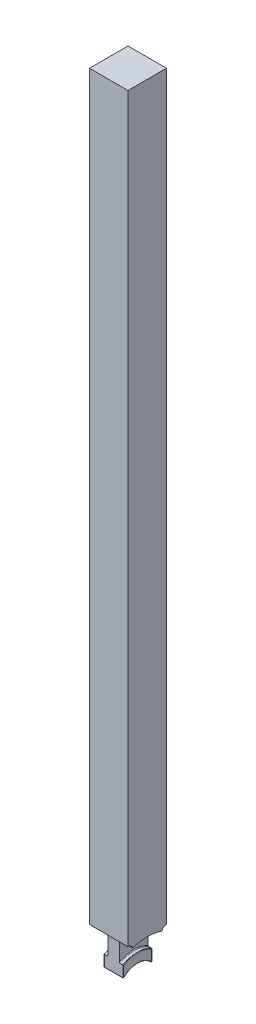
ISO-10303-21;
HEADER;
FILE_DESCRIPTION(('STEP AP214'),'2;1');
FILE_NAME('part.step','',(''),(''),'','','');
FILE_SCHEMA(('AUTOMOTIVE_DESIGN { 1 0 10303 214 1 1 1 1 }'));
ENDSEC;
DATA;
#1=APPLICATION_CONTEXT('core data for automotive mechanical design processes');
#2=APPLICATION_PROTOCOL_DEFINITION('international standard','automotive_design',2000,#1);
#3=PRODUCT_CONTEXT('',#1,'mechanical');
#4=PRODUCT('Part','Part','',(#3));
#5=PRODUCT_RELATED_PRODUCT_CATEGORY('part','',(#4));
#6=PRODUCT_DEFINITION_FORMATION('','',#4);
#7=PRODUCT_DEFINITION_CONTEXT('part definition',#1,'design');
#8=PRODUCT_DEFINITION('design','',#6,#7);
#9=PRODUCT_DEFINITION_SHAPE('','',#8);
#10=(LENGTH_UNIT() NAMED_UNIT(*) SI_UNIT(.MILLI.,.METRE.));
#11=(NAMED_UNIT(*) PLANE_ANGLE_UNIT() SI_UNIT($,.RADIAN.));
#12=(NAMED_UNIT(*) SI_UNIT($,.STERADIAN.) SOLID_ANGLE_UNIT());
#13=UNCERTAINTY_MEASURE_WITH_UNIT(LENGTH_MEASURE(1.E-05),#10,'distance_accuracy_value','');
#14=(GEOMETRIC_REPRESENTATION_CONTEXT(3) GLOBAL_UNCERTAINTY_ASSIGNED_CONTEXT((#13)) GLOBAL_UNIT_ASSIGNED_CONTEXT((#10,
#11,#12)) REPRESENTATION_CONTEXT('',''));
#15=CARTESIAN_POINT('',(0.,0.,0.));
#16=DIRECTION('',(0.,0.,1.));
#17=DIRECTION('',(1.,0.,0.));
#18=AXIS2_PLACEMENT_3D('',#15,#16,#17);
#19=CARTESIAN_POINT('',(10.,410.,10.));
#20=DIRECTION('',(0.,0.,-1.));
#21=DIRECTION('',(0.,1.,0.));
#22=AXIS2_PLACEMENT_3D('',#19,#20,#21);
#23=PLANE('',#22);
#24=DIRECTION('',(0.,-1.,0.));
#25=VECTOR('',#24,1.);
#26=CARTESIAN_POINT('',(-10.,410.,10.));
#27=LINE('',#26,#25);
#28=CARTESIAN_POINT('',(-10.,410.,10.));
#29=VERTEX_POINT('',#28);
#30=CARTESIAN_POINT('',(-10.,25.,10.));
#31=VERTEX_POINT('',#30);
#32=EDGE_CURVE('E315',#29,#31,#27,.T.);
#33=ORIENTED_EDGE('',*,*,#32,.T.);
#34=DIRECTION('',(1.,0.,0.));
#35=VECTOR('',#34,1.);
#36=CARTESIAN_POINT('',(10.,25.,9.99999999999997));
#37=LINE('',#36,#35);
#38=CARTESIAN_POINT('',(10.,25.,10.));
#39=VERTEX_POINT('',#38);
#40=EDGE_CURVE('E294',#31,#39,#37,.T.);
#41=ORIENTED_EDGE('',*,*,#40,.T.);
#42=DIRECTION('',(0.,-1.,0.));
#43=VECTOR('',#42,1.);
#44=CARTESIAN_POINT('',(10.,410.,10.));
#45=LINE('',#44,#43);
#46=CARTESIAN_POINT('',(10.,410.,10.));
#47=VERTEX_POINT('',#46);
#48=EDGE_CURVE('E306',#47,#39,#45,.T.);
#49=ORIENTED_EDGE('',*,*,#48,.F.);
#50=DIRECTION('',(-1.,0.,0.));
#51=VECTOR('',#50,1.);
#52=CARTESIAN_POINT('',(10.,410.,10.));
#53=LINE('',#52,#51);
#54=EDGE_CURVE('E321',#47,#29,#53,.T.);
#55=ORIENTED_EDGE('',*,*,#54,.T.);
#56=EDGE_LOOP('',(#33,#41,#49,#55));
#57=FACE_BOUND('',#56,.T.);
#58=ADVANCED_FACE('F37',(#57),#23,.F.);
#59=CARTESIAN_POINT('',(10.,410.,-9.99999999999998));
#60=DIRECTION('',(0.,0.,1.));
#61=DIRECTION('',(0.,-1.,0.));
#62=AXIS2_PLACEMENT_3D('',#59,#60,#61);
#63=PLANE('',#62);
#64=DIRECTION('',(0.,1.,0.));
#65=VECTOR('',#64,1.);
#66=CARTESIAN_POINT('',(10.,410.,-9.99999999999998));
#67=LINE('',#66,#65);
#68=CARTESIAN_POINT('',(10.,25.,-10.));
#69=VERTEX_POINT('',#68);
#70=CARTESIAN_POINT('',(10.,410.,-9.99999999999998));
#71=VERTEX_POINT('',#70);
#72=EDGE_CURVE('E310',#69,#71,#67,.T.);
#73=ORIENTED_EDGE('',*,*,#72,.F.);
#74=DIRECTION('',(-1.,0.,0.));
#75=VECTOR('',#74,1.);
#76=CARTESIAN_POINT('',(10.,25.,-10.));
#77=LINE('',#76,#75);
#78=CARTESIAN_POINT('',(-10.,25.,-10.));
#79=VERTEX_POINT('',#78);
#80=EDGE_CURVE('E233',#69,#79,#77,.T.);
#81=ORIENTED_EDGE('',*,*,#80,.T.);
#82=DIRECTION('',(0.,1.,0.));
#83=VECTOR('',#82,1.);
#84=CARTESIAN_POINT('',(-10.,410.,-9.99999999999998));
#85=LINE('',#84,#83);
#86=CARTESIAN_POINT('',(-10.,410.,-9.99999999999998));
#87=VERTEX_POINT('',#86);
#88=EDGE_CURVE('E307',#79,#87,#85,.T.);
#89=ORIENTED_EDGE('',*,*,#88,.T.);
#90=DIRECTION('',(-1.,0.,0.));
#91=VECTOR('',#90,1.);
#92=CARTESIAN_POINT('',(10.,410.,-9.99999999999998));
#93=LINE('',#92,#91);
#94=EDGE_CURVE('E312',#71,#87,#93,.T.);
#95=ORIENTED_EDGE('',*,*,#94,.F.);
#96=EDGE_LOOP('',(#73,#81,#89,#95));
#97=FACE_BOUND('',#96,.T.);
#98=ADVANCED_FACE('F481',(#97),#63,.F.);
#99=CARTESIAN_POINT('',(-10.,0.,0.));
#100=DIRECTION('',(-1.,0.,0.));
#101=DIRECTION('',(0.,0.,1.));
#102=AXIS2_PLACEMENT_3D('',#99,#100,#101);
#103=PLANE('',#102);
#104=CARTESIAN_POINT('',(-10.,22.6124,-9.8876));
#105=DIRECTION('',(1.,0.,0.));
#106=DIRECTION('',(0.,0.,1.));
#107=AXIS2_PLACEMENT_3D('',#104,#105,#106);
#108=CIRCLE('',#107,2.3876);
#109=CARTESIAN_POINT('',(-10.,25.,-9.8876));
#110=VERTEX_POINT('',#109);
#111=CARTESIAN_POINT('',(-10.,23.2918345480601,-7.59871327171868));
#112=VERTEX_POINT('',#111);
#113=EDGE_CURVE('E245',#110,#112,#108,.T.);
#114=ORIENTED_EDGE('',*,*,#113,.T.);
#115=CARTESIAN_POINT('',(-10.,0.,0.));
#116=DIRECTION('',(-1.,0.,0.));
#117=DIRECTION('',(0.,0.,1.));
#118=AXIS2_PLACEMENT_3D('',#115,#116,#117);
#119=CIRCLE('',#118,24.5);
#120=CARTESIAN_POINT('',(-10.,23.2918345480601,7.59871327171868));
#121=VERTEX_POINT('',#120);
#122=EDGE_CURVE('E298',#121,#112,#119,.T.);
#123=ORIENTED_EDGE('',*,*,#122,.F.);
#124=CARTESIAN_POINT('',(-10.,22.6124,9.8876));
#125=DIRECTION('',(1.,0.,0.));
#126=DIRECTION('',(0.,0.,-1.));
#127=AXIS2_PLACEMENT_3D('',#124,#125,#126);
#128=CIRCLE('',#127,2.3876);
#129=CARTESIAN_POINT('',(-10.,25.,9.8876));
#130=VERTEX_POINT('',#129);
#131=EDGE_CURVE('E265',#121,#130,#128,.T.);
#132=ORIENTED_EDGE('',*,*,#131,.T.);
#133=DIRECTION('',(0.,0.,1.));
#134=VECTOR('',#133,1.);
#135=CARTESIAN_POINT('',(-10.,25.,9.8876));
#136=LINE('',#135,#134);
#137=EDGE_CURVE('E268',#130,#31,#136,.T.);
#138=ORIENTED_EDGE('',*,*,#137,.T.);
#139=ORIENTED_EDGE('',*,*,#32,.F.);
#140=DIRECTION('',(0.,0.,1.));
#141=VECTOR('',#140,1.);
#142=CARTESIAN_POINT('',(-10.,410.,10.));
#143=LINE('',#142,#141);
#144=EDGE_CURVE('E300',#87,#29,#143,.T.);
#145=ORIENTED_EDGE('',*,*,#144,.F.);
#146=ORIENTED_EDGE('',*,*,#88,.F.);
#147=DIRECTION('',(0.,0.,1.));
#148=VECTOR('',#147,1.);
#149=CARTESIAN_POINT('',(-10.,25.,-9.8876));
#150=LINE('',#149,#148);
#151=EDGE_CURVE('E254',#79,#110,#150,.T.);
#152=ORIENTED_EDGE('',*,*,#151,.T.);
#153=EDGE_LOOP('',(#114,#123,#132,#138,#139,#145,#146,#152));
#154=FACE_BOUND('',#153,.T.);
#155=ADVANCED_FACE('F486',(#154),#103,.T.);
#156=CARTESIAN_POINT('',(10.,410.,10.));
#157=DIRECTION('',(0.,-1.,0.));
#158=DIRECTION('',(0.,0.,-1.));
#159=AXIS2_PLACEMENT_3D('',#156,#157,#158);
#160=PLANE('',#159);
#161=ORIENTED_EDGE('',*,*,#144,.T.);
#162=ORIENTED_EDGE('',*,*,#54,.F.);
#163=DIRECTION('',(0.,0.,1.));
#164=VECTOR('',#163,1.);
#165=CARTESIAN_POINT('',(10.,410.,10.));
#166=LINE('',#165,#164);
#167=EDGE_CURVE('E303',#71,#47,#166,.T.);
#168=ORIENTED_EDGE('',*,*,#167,.F.);
#169=ORIENTED_EDGE('',*,*,#94,.T.);
#170=EDGE_LOOP('',(#161,#162,#168,#169));
#171=FACE_BOUND('',#170,.T.);
#172=ADVANCED_FACE('F372',(#171),#160,.F.);
#173=CARTESIAN_POINT('',(10.,0.,0.));
#174=DIRECTION('',(-1.,0.,0.));
#175=DIRECTION('',(0.,0.,1.));
#176=AXIS2_PLACEMENT_3D('',#173,#174,#175);
#177=PLANE('',#176);
#178=CARTESIAN_POINT('',(10.,0.,0.));
#179=DIRECTION('',(-1.,0.,0.));
#180=DIRECTION('',(0.,0.,1.));
#181=AXIS2_PLACEMENT_3D('',#178,#179,#180);
#182=CIRCLE('',#181,24.5);
#183=CARTESIAN_POINT('',(10.,23.2918345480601,7.59871327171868));
#184=VERTEX_POINT('',#183);
#185=CARTESIAN_POINT('',(10.,23.2918345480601,-7.59871327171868));
#186=VERTEX_POINT('',#185);
#187=EDGE_CURVE('E253',#184,#186,#182,.T.);
#188=ORIENTED_EDGE('',*,*,#187,.T.);
#189=CARTESIAN_POINT('',(10.,22.6124,-9.8876));
#190=DIRECTION('',(1.,0.,0.));
#191=DIRECTION('',(0.,0.,1.));
#192=AXIS2_PLACEMENT_3D('',#189,#190,#191);
#193=CIRCLE('',#192,2.3876);
#194=CARTESIAN_POINT('',(10.,25.,-9.8876));
#195=VERTEX_POINT('',#194);
#196=EDGE_CURVE('E237',#195,#186,#193,.T.);
#197=ORIENTED_EDGE('',*,*,#196,.F.);
#198=DIRECTION('',(0.,0.,1.));
#199=VECTOR('',#198,1.);
#200=CARTESIAN_POINT('',(10.,25.,-9.8876));
#201=LINE('',#200,#199);
#202=EDGE_CURVE('E227',#69,#195,#201,.T.);
#203=ORIENTED_EDGE('',*,*,#202,.F.);
#204=ORIENTED_EDGE('',*,*,#72,.T.);
#205=ORIENTED_EDGE('',*,*,#167,.T.);
#206=ORIENTED_EDGE('',*,*,#48,.T.);
#207=DIRECTION('',(0.,0.,1.));
#208=VECTOR('',#207,1.);
#209=CARTESIAN_POINT('',(10.,25.,9.8876));
#210=LINE('',#209,#208);
#211=CARTESIAN_POINT('',(10.,25.,9.8876));
#212=VERTEX_POINT('',#211);
#213=EDGE_CURVE('E263',#212,#39,#210,.T.);
#214=ORIENTED_EDGE('',*,*,#213,.F.);
#215=CARTESIAN_POINT('',(10.,22.6124,9.8876));
#216=DIRECTION('',(1.,0.,0.));
#217=DIRECTION('',(0.,0.,-1.));
#218=AXIS2_PLACEMENT_3D('',#215,#216,#217);
#219=CIRCLE('',#218,2.3876);
#220=EDGE_CURVE('E261',#184,#212,#219,.T.);
#221=ORIENTED_EDGE('',*,*,#220,.F.);
#222=EDGE_LOOP('',(#188,#197,#203,#204,#205,#206,#214,#221));
#223=FACE_BOUND('',#222,.T.);
#224=ADVANCED_FACE('F250',(#223),#177,.F.);
#225=CARTESIAN_POINT('',(-10.,0.,0.));
#226=DIRECTION('',(1.,0.,0.));
#227=DIRECTION('',(0.,0.,-1.));
#228=AXIS2_PLACEMENT_3D('',#225,#226,#227);
#229=CYLINDRICAL_SURFACE('',#228,10.);
#230=CARTESIAN_POINT('',(-4.746,0.,0.));
#231=DIRECTION('',(1.,0.,0.));
#232=DIRECTION('',(0.,1.,0.));
#233=AXIS2_PLACEMENT_3D('',#230,#231,#232);
#234=CIRCLE('',#233,10.);
#235=CARTESIAN_POINT('',(-4.746,7.07562205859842,7.06651062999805));
#236=VERTEX_POINT('',#235);
#237=CARTESIAN_POINT('',(-4.746,7.07562205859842,-7.06651062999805));
#238=VERTEX_POINT('',#237);
#239=EDGE_CURVE('E960',#236,#238,#234,.F.);
#240=ORIENTED_EDGE('',*,*,#239,.T.);
#241=DIRECTION('',(1.,0.,0.));
#242=VECTOR('',#241,1.);
#243=CARTESIAN_POINT('',(-10.,7.07562205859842,-7.06651062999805));
#244=LINE('',#243,#242);
#245=CARTESIAN_POINT('',(4.746,7.07562205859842,-7.06651062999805));
#246=VERTEX_POINT('',#245);
#247=EDGE_CURVE('E969',#238,#246,#244,.T.);
#248=ORIENTED_EDGE('',*,*,#247,.T.);
#249=CARTESIAN_POINT('',(4.746,0.,0.));
#250=DIRECTION('',(-1.,0.,0.));
#251=DIRECTION('',(0.,-1.,0.));
#252=AXIS2_PLACEMENT_3D('',#249,#250,#251);
#253=CIRCLE('',#252,10.);
#254=CARTESIAN_POINT('',(4.746,7.07562205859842,7.06651062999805));
#255=VERTEX_POINT('',#254);
#256=EDGE_CURVE('E966',#246,#255,#253,.F.);
#257=ORIENTED_EDGE('',*,*,#256,.T.);
#258=DIRECTION('',(1.,0.,0.));
#259=VECTOR('',#258,1.);
#260=CARTESIAN_POINT('',(-10.,7.07562205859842,7.06651062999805));
#261=LINE('',#260,#259);
#262=EDGE_CURVE('E958',#255,#236,#261,.F.);
#263=ORIENTED_EDGE('',*,*,#262,.T.);
#264=EDGE_LOOP('',(#240,#248,#257,#263));
#265=FACE_BOUND('',#264,.T.);
#266=ADVANCED_FACE('F495',(#265),#229,.F.);
#267=CARTESIAN_POINT('',(-3.,15.,0.));
#268=DIRECTION('',(-1.,0.,0.));
#269=DIRECTION('',(0.,0.,1.));
#270=AXIS2_PLACEMENT_3D('',#267,#268,#269);
#271=PLANE('',#270);
#272=DIRECTION('',(0.,1.,0.));
#273=VECTOR('',#272,1.);
#274=CARTESIAN_POINT('',(-3.,15.,-7.5));
#275=LINE('',#274,#273);
#276=CARTESIAN_POINT('',(-3.,13.428520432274,-7.5));
#277=VERTEX_POINT('',#276);
#278=CARTESIAN_POINT('',(-3.,22.5220479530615,-7.5));
#279=VERTEX_POINT('',#278);
#280=EDGE_CURVE('E292',#277,#279,#275,.T.);
#281=ORIENTED_EDGE('',*,*,#280,.F.);
#282=CARTESIAN_POINT('',(-3.,0.,0.));
#283=DIRECTION('',(-1.,0.,0.));
#284=DIRECTION('',(0.,0.,1.));
#285=AXIS2_PLACEMENT_3D('',#282,#283,#284);
#286=CIRCLE('',#285,15.381);
#287=CARTESIAN_POINT('',(-3.,13.428520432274,7.5));
#288=VERTEX_POINT('',#287);
#289=EDGE_CURVE('E421',#277,#288,#286,.F.);
#290=ORIENTED_EDGE('',*,*,#289,.T.);
#291=DIRECTION('',(0.,-1.,0.));
#292=VECTOR('',#291,1.);
#293=CARTESIAN_POINT('',(-3.,15.,7.5));
#294=LINE('',#293,#292);
#295=CARTESIAN_POINT('',(-3.,22.5220479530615,7.5));
#296=VERTEX_POINT('',#295);
#297=EDGE_CURVE('E284',#296,#288,#294,.T.);
#298=ORIENTED_EDGE('',*,*,#297,.F.);
#299=CARTESIAN_POINT('',(-3.,0.,0.));
#300=DIRECTION('',(-1.,0.,0.));
#301=DIRECTION('',(0.,0.,1.));
#302=AXIS2_PLACEMENT_3D('',#299,#300,#301);
#303=CIRCLE('',#302,23.738);
#304=EDGE_CURVE('E333',#296,#279,#303,.T.);
#305=ORIENTED_EDGE('',*,*,#304,.T.);
#306=EDGE_LOOP('',(#281,#290,#298,#305));
#307=FACE_BOUND('',#306,.T.);
#308=ADVANCED_FACE('F498',(#307),#271,.T.);
#309=CARTESIAN_POINT('',(-8.84822894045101,0.,0.));
#310=DIRECTION('',(-1.,0.,0.));
#311=DIRECTION('',(0.,0.,1.));
#312=AXIS2_PLACEMENT_3D('',#309,#310,#311);
#313=CYLINDRICAL_SURFACE('',#312,24.5);
#314=DIRECTION('',(1.,0.,0.));
#315=VECTOR('',#314,1.);
#316=CARTESIAN_POINT('',(-6.50000000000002,23.2918345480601,-7.59871327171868));
#317=LINE('',#316,#315);
#318=CARTESIAN_POINT('',(-3.762,23.2918345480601,-7.59871327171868));
#319=VERTEX_POINT('',#318);
#320=EDGE_CURVE('E277',#319,#112,#317,.F.);
#321=ORIENTED_EDGE('',*,*,#320,.F.);
#322=CARTESIAN_POINT('',(-3.762,0.,0.));
#323=DIRECTION('',(-1.,0.,0.));
#324=DIRECTION('',(0.,0.,1.));
#325=AXIS2_PLACEMENT_3D('',#322,#323,#324);
#326=CIRCLE('',#325,24.5);
#327=CARTESIAN_POINT('',(-3.762,23.2918345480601,7.59871327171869));
#328=VERTEX_POINT('',#327);
#329=EDGE_CURVE('E336',#319,#328,#326,.F.);
#330=ORIENTED_EDGE('',*,*,#329,.T.);
#331=DIRECTION('',(1.,0.,0.));
#332=VECTOR('',#331,1.);
#333=CARTESIAN_POINT('',(-6.50000000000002,23.2918345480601,7.59871327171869));
#334=LINE('',#333,#332);
#335=EDGE_CURVE('E259',#121,#328,#334,.T.);
#336=ORIENTED_EDGE('',*,*,#335,.F.);
#337=ORIENTED_EDGE('',*,*,#122,.T.);
#338=EDGE_LOOP('',(#321,#330,#336,#337));
#339=FACE_BOUND('',#338,.T.);
#340=ADVANCED_FACE('F500',(#339),#313,.F.);
#341=CARTESIAN_POINT('',(-8.84822894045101,0.,0.));
#342=DIRECTION('',(-1.,0.,0.));
#343=DIRECTION('',(0.,0.,1.));
#344=AXIS2_PLACEMENT_3D('',#341,#342,#343);
#345=CYLINDRICAL_SURFACE('',#344,15.);
#346=DIRECTION('',(-1.,0.,0.));
#347=VECTOR('',#346,1.);
#348=CARTESIAN_POINT('',(-8.84822894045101,12.9903810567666,-7.5));
#349=LINE('',#348,#347);
#350=CARTESIAN_POINT('',(-4.746,12.9903810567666,-7.5));
#351=VERTEX_POINT('',#350);
#352=CARTESIAN_POINT('',(-3.381,12.9903810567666,-7.5));
#353=VERTEX_POINT('',#352);
#354=EDGE_CURVE('E290',#351,#353,#349,.F.);
#355=ORIENTED_EDGE('',*,*,#354,.F.);
#356=CARTESIAN_POINT('',(-4.746,0.,0.));
#357=DIRECTION('',(1.,0.,0.));
#358=DIRECTION('',(0.,1.,0.));
#359=AXIS2_PLACEMENT_3D('',#356,#357,#358);
#360=CIRCLE('',#359,15.);
#361=CARTESIAN_POINT('',(-4.746,12.9903810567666,7.5));
#362=VERTEX_POINT('',#361);
#363=EDGE_CURVE('E11',#351,#362,#360,.T.);
#364=ORIENTED_EDGE('',*,*,#363,.T.);
#365=DIRECTION('',(-1.,0.,0.));
#366=VECTOR('',#365,1.);
#367=CARTESIAN_POINT('',(-8.84822894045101,12.9903810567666,7.5));
#368=LINE('',#367,#366);
#369=CARTESIAN_POINT('',(-3.381,12.9903810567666,7.5));
#370=VERTEX_POINT('',#369);
#371=EDGE_CURVE('E281',#370,#362,#368,.T.);
#372=ORIENTED_EDGE('',*,*,#371,.F.);
#373=CARTESIAN_POINT('',(-3.381,0.,0.));
#374=DIRECTION('',(-1.,0.,0.));
#375=DIRECTION('',(0.,0.,1.));
#376=AXIS2_PLACEMENT_3D('',#373,#374,#375);
#377=CIRCLE('',#376,15.);
#378=EDGE_CURVE('E412',#370,#353,#377,.T.);
#379=ORIENTED_EDGE('',*,*,#378,.T.);
#380=EDGE_LOOP('',(#355,#364,#372,#379));
#381=FACE_BOUND('',#380,.T.);
#382=ADVANCED_FACE('F503',(#381),#345,.T.);
#383=CARTESIAN_POINT('',(3.,15.,0.));
#384=DIRECTION('',(1.,0.,0.));
#385=DIRECTION('',(0.,0.,-1.));
#386=AXIS2_PLACEMENT_3D('',#383,#384,#385);
#387=PLANE('',#386);
#388=DIRECTION('',(0.,1.,0.));
#389=VECTOR('',#388,1.);
#390=CARTESIAN_POINT('',(3.,15.,7.5));
#391=LINE('',#390,#389);
#392=CARTESIAN_POINT('',(3.,13.428520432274,7.5));
#393=VERTEX_POINT('',#392);
#394=CARTESIAN_POINT('',(3.,22.5220479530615,7.5));
#395=VERTEX_POINT('',#394);
#396=EDGE_CURVE('E279',#393,#395,#391,.T.);
#397=ORIENTED_EDGE('',*,*,#396,.F.);
#398=CARTESIAN_POINT('',(3.,0.,0.));
#399=DIRECTION('',(1.,0.,0.));
#400=DIRECTION('',(0.,0.,-1.));
#401=AXIS2_PLACEMENT_3D('',#398,#399,#400);
#402=CIRCLE('',#401,15.381);
#403=CARTESIAN_POINT('',(3.,13.428520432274,-7.5));
#404=VERTEX_POINT('',#403);
#405=EDGE_CURVE('E423',#393,#404,#402,.F.);
#406=ORIENTED_EDGE('',*,*,#405,.T.);
#407=DIRECTION('',(0.,-1.,0.));
#408=VECTOR('',#407,1.);
#409=CARTESIAN_POINT('',(3.,15.,-7.5));
#410=LINE('',#409,#408);
#411=CARTESIAN_POINT('',(3.,22.5220479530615,-7.5));
#412=VERTEX_POINT('',#411);
#413=EDGE_CURVE('E287',#412,#404,#410,.T.);
#414=ORIENTED_EDGE('',*,*,#413,.F.);
#415=CARTESIAN_POINT('',(3.,0.,0.));
#416=DIRECTION('',(1.,0.,0.));
#417=DIRECTION('',(0.,0.,-1.));
#418=AXIS2_PLACEMENT_3D('',#415,#416,#417);
#419=CIRCLE('',#418,23.738);
#420=EDGE_CURVE('E341',#412,#395,#419,.T.);
#421=ORIENTED_EDGE('',*,*,#420,.T.);
#422=EDGE_LOOP('',(#397,#406,#414,#421));
#423=FACE_BOUND('',#422,.T.);
#424=ADVANCED_FACE('F507',(#423),#387,.T.);
#425=CARTESIAN_POINT('',(-8.84822894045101,0.,0.));
#426=DIRECTION('',(-1.,0.,0.));
#427=DIRECTION('',(0.,0.,1.));
#428=AXIS2_PLACEMENT_3D('',#425,#426,#427);
#429=CYLINDRICAL_SURFACE('',#428,15.);
#430=DIRECTION('',(-1.,0.,0.));
#431=VECTOR('',#430,1.);
#432=CARTESIAN_POINT('',(-8.84822894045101,12.9903810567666,7.5));
#433=LINE('',#432,#431);
#434=CARTESIAN_POINT('',(4.746,12.9903810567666,7.5));
#435=VERTEX_POINT('',#434);
#436=CARTESIAN_POINT('',(3.381,12.9903810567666,7.5));
#437=VERTEX_POINT('',#436);
#438=EDGE_CURVE('E328',#435,#437,#433,.T.);
#439=ORIENTED_EDGE('',*,*,#438,.F.);
#440=CARTESIAN_POINT('',(4.746,0.,0.));
#441=DIRECTION('',(-1.,0.,0.));
#442=DIRECTION('',(0.,-1.,0.));
#443=AXIS2_PLACEMENT_3D('',#440,#441,#442);
#444=CIRCLE('',#443,15.);
#445=CARTESIAN_POINT('',(4.746,12.9903810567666,-7.5));
#446=VERTEX_POINT('',#445);
#447=EDGE_CURVE('E977',#435,#446,#444,.T.);
#448=ORIENTED_EDGE('',*,*,#447,.T.);
#449=DIRECTION('',(-1.,0.,0.));
#450=VECTOR('',#449,1.);
#451=CARTESIAN_POINT('',(-8.84822894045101,12.9903810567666,-7.5));
#452=LINE('',#451,#450);
#453=CARTESIAN_POINT('',(3.381,12.9903810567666,-7.5));
#454=VERTEX_POINT('',#453);
#455=EDGE_CURVE('E330',#454,#446,#452,.F.);
#456=ORIENTED_EDGE('',*,*,#455,.F.);
#457=CARTESIAN_POINT('',(3.381,0.,0.));
#458=DIRECTION('',(1.,0.,0.));
#459=DIRECTION('',(0.,0.,-1.));
#460=AXIS2_PLACEMENT_3D('',#457,#458,#459);
#461=CIRCLE('',#460,15.);
#462=EDGE_CURVE('E426',#454,#437,#461,.T.);
#463=ORIENTED_EDGE('',*,*,#462,.T.);
#464=EDGE_LOOP('',(#439,#448,#456,#463));
#465=FACE_BOUND('',#464,.T.);
#466=ADVANCED_FACE('F512',(#465),#429,.T.);
#467=CARTESIAN_POINT('',(-8.84822894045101,0.,0.));
#468=DIRECTION('',(-1.,0.,0.));
#469=DIRECTION('',(0.,0.,1.));
#470=AXIS2_PLACEMENT_3D('',#467,#468,#469);
#471=CYLINDRICAL_SURFACE('',#470,24.5);
#472=DIRECTION('',(1.,0.,0.));
#473=VECTOR('',#472,1.);
#474=CARTESIAN_POINT('',(6.50000000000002,23.2918345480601,7.59871327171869));
#475=LINE('',#474,#473);
#476=CARTESIAN_POINT('',(3.762,23.2918345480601,7.59871327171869));
#477=VERTEX_POINT('',#476);
#478=EDGE_CURVE('E324',#477,#184,#475,.T.);
#479=ORIENTED_EDGE('',*,*,#478,.F.);
#480=CARTESIAN_POINT('',(3.762,0.,0.));
#481=DIRECTION('',(1.,0.,0.));
#482=DIRECTION('',(0.,0.,-1.));
#483=AXIS2_PLACEMENT_3D('',#480,#481,#482);
#484=CIRCLE('',#483,24.5);
#485=CARTESIAN_POINT('',(3.762,23.2918345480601,-7.59871327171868));
#486=VERTEX_POINT('',#485);
#487=EDGE_CURVE('E338',#477,#486,#484,.F.);
#488=ORIENTED_EDGE('',*,*,#487,.T.);
#489=DIRECTION('',(1.,0.,0.));
#490=VECTOR('',#489,1.);
#491=CARTESIAN_POINT('',(6.50000000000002,23.2918345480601,-7.59871327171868));
#492=LINE('',#491,#490);
#493=EDGE_CURVE('E326',#186,#486,#492,.F.);
#494=ORIENTED_EDGE('',*,*,#493,.F.);
#495=ORIENTED_EDGE('',*,*,#187,.F.);
#496=EDGE_LOOP('',(#479,#488,#494,#495));
#497=FACE_BOUND('',#496,.T.);
#498=ADVANCED_FACE('F401',(#497),#471,.F.);
#499=CARTESIAN_POINT('',(-10.,25.,9.8876));
#500=DIRECTION('',(0.,1.,0.));
#501=DIRECTION('',(0.,0.,1.));
#502=AXIS2_PLACEMENT_3D('',#499,#500,#501);
#503=PLANE('',#502);
#504=ORIENTED_EDGE('',*,*,#137,.F.);
#505=DIRECTION('',(1.,0.,0.));
#506=VECTOR('',#505,1.);
#507=CARTESIAN_POINT('',(-10.,25.,9.8876));
#508=LINE('',#507,#506);
#509=EDGE_CURVE('E271',#130,#212,#508,.T.);
#510=ORIENTED_EDGE('',*,*,#509,.T.);
#511=ORIENTED_EDGE('',*,*,#213,.T.);
#512=ORIENTED_EDGE('',*,*,#40,.F.);
#513=EDGE_LOOP('',(#504,#510,#511,#512));
#514=FACE_BOUND('',#513,.T.);
#515=ADVANCED_FACE('F400',(#514),#503,.F.);
#516=CARTESIAN_POINT('',(-10.,0.,7.5));
#517=DIRECTION('',(0.,0.,-1.));
#518=DIRECTION('',(0.,1.,0.));
#519=AXIS2_PLACEMENT_3D('',#516,#517,#518);
#520=PLANE('',#519);
#521=DIRECTION('',(1.,0.,0.));
#522=VECTOR('',#521,1.);
#523=CARTESIAN_POINT('',(-10.,7.25534285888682,7.5));
#524=LINE('',#523,#522);
#525=CARTESIAN_POINT('',(-4.746,7.25534285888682,7.5));
#526=VERTEX_POINT('',#525);
#527=CARTESIAN_POINT('',(4.746,7.25534285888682,7.5));
#528=VERTEX_POINT('',#527);
#529=EDGE_CURVE('E971',#526,#528,#524,.T.);
#530=ORIENTED_EDGE('',*,*,#529,.T.);
#531=DIRECTION('',(0.,1.,0.));
#532=VECTOR('',#531,1.);
#533=CARTESIAN_POINT('',(4.746,0.,7.5));
#534=LINE('',#533,#532);
#535=EDGE_CURVE('E975',#528,#435,#534,.T.);
#536=ORIENTED_EDGE('',*,*,#535,.T.);
#537=ORIENTED_EDGE('',*,*,#438,.T.);
#538=CARTESIAN_POINT('',(3.381,12.9903810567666,7.5));
#539=CARTESIAN_POINT('',(3.36159348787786,12.9903515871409,7.5));
#540=CARTESIAN_POINT('',(3.34220939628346,12.9920910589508,7.5));
#541=CARTESIAN_POINT('',(3.30411089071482,12.9988686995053,7.5));
#542=CARTESIAN_POINT('',(3.28539391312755,13.0038923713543,7.5));
#543=CARTESIAN_POINT('',(3.24909102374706,13.0169971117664,7.5));
#544=CARTESIAN_POINT('',(3.23150411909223,13.0250754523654,7.5));
#545=CARTESIAN_POINT('',(3.19783116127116,13.0439266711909,7.5));
#546=CARTESIAN_POINT('',(3.18174642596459,13.054701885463,7.5));
#547=CARTESIAN_POINT('',(3.15058262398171,13.0791681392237,7.5));
#548=CARTESIAN_POINT('',(3.1356009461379,13.0929827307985,7.5));
#549=CARTESIAN_POINT('',(3.10785285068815,13.1226713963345,7.5));
#550=CARTESIAN_POINT('',(3.09508691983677,13.1385459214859,7.5));
#551=CARTESIAN_POINT('',(3.07041818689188,13.174041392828,7.5));
#552=CARTESIAN_POINT('',(3.05883169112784,13.1938820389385,7.5));
#553=CARTESIAN_POINT('',(3.03871875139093,13.235070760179,7.5));
#554=CARTESIAN_POINT('',(3.03019562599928,13.2564204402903,7.5));
#555=CARTESIAN_POINT('',(3.01549657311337,13.3025258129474,7.5));
#556=CARTESIAN_POINT('',(3.00968374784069,13.327397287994,7.5));
#557=CARTESIAN_POINT('',(3.00193752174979,13.3776913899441,7.5));
#558=CARTESIAN_POINT('',(2.99999691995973,13.4031129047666,7.5));
#559=CARTESIAN_POINT('',(3.,13.428520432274,7.5));
#560=B_SPLINE_CURVE_WITH_KNOTS('',3,(#538,#539,#540,#541,#542,#543,#544,#545,#546,#547,#548,
#549,#550,#551,#552,#553,#554,#555,#556,#557,#558,#559),.UNSPECIFIED.,.F.,.F.,(4,2,2,2,2,2,2,2,
2,2,4),(0.,0.0581065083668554,0.115958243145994,0.173758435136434,0.231608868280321,
0.292501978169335,0.35340844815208,0.422061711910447,0.490789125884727,0.567105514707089,
0.643279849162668),.UNSPECIFIED.);
#561=EDGE_CURVE('E462',#437,#393,#560,.T.);
#562=ORIENTED_EDGE('',*,*,#561,.T.);
#563=ORIENTED_EDGE('',*,*,#396,.T.);
#564=CARTESIAN_POINT('',(3.,22.5220479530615,7.5));
#565=CARTESIAN_POINT('',(3.00000022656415,22.5371498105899,7.5));
#566=CARTESIAN_POINT('',(3.0004036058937,22.5522300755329,7.5));
#567=CARTESIAN_POINT('',(3.00201667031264,22.5823474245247,7.5));
#568=CARTESIAN_POINT('',(3.003226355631,22.5973845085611,7.5));
#569=CARTESIAN_POINT('',(3.00483919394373,22.6124,7.5));
#570=B_SPLINE_CURVE_WITH_KNOTS('',3,(#564,#565,#566,#567,#568,#569),.UNSPECIFIED.,.F.,.F.,(4,2,
4),(0.,0.045256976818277,0.0905139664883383),.UNSPECIFIED.);
#571=CARTESIAN_POINT('',(3.00483919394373,22.6124,7.5));
#572=VERTEX_POINT('',#571);
#573=EDGE_CURVE('E413',#395,#572,#570,.T.);
#574=ORIENTED_EDGE('',*,*,#573,.T.);
#575=DIRECTION('',(1.,0.,0.));
#576=VECTOR('',#575,1.);
#577=CARTESIAN_POINT('',(-10.,22.6124,7.5));
#578=LINE('',#577,#576);
#579=CARTESIAN_POINT('',(-3.00483919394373,22.6124,7.5));
#580=VERTEX_POINT('',#579);
#581=EDGE_CURVE('E238',#580,#572,#578,.T.);
#582=ORIENTED_EDGE('',*,*,#581,.F.);
#583=CARTESIAN_POINT('',(-3.00483919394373,22.6124,7.5));
#584=CARTESIAN_POINT('',(-3.003226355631,22.5973845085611,7.5));
#585=CARTESIAN_POINT('',(-3.00201667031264,22.5823474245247,7.5));
#586=CARTESIAN_POINT('',(-3.0004036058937,22.5522300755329,7.5));
#587=CARTESIAN_POINT('',(-3.00000022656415,22.5371498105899,7.5));
#588=CARTESIAN_POINT('',(-3.,22.5220479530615,7.5));
#589=B_SPLINE_CURVE_WITH_KNOTS('',3,(#583,#584,#585,#586,#587,#588),.UNSPECIFIED.,.F.,.F.,(4,2,
4),(0.,0.0452569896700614,0.0905139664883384),.UNSPECIFIED.);
#590=EDGE_CURVE('E387',#580,#296,#589,.T.);
#591=ORIENTED_EDGE('',*,*,#590,.T.);
#592=ORIENTED_EDGE('',*,*,#297,.T.);
#593=CARTESIAN_POINT('',(-3.,13.428520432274,7.5));
#594=CARTESIAN_POINT('',(-2.99998773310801,13.3960473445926,7.5));
#595=CARTESIAN_POINT('',(-3.00316588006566,13.3635248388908,7.5));
#596=CARTESIAN_POINT('',(-3.01585357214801,13.2995632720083,7.5));
#597=CARTESIAN_POINT('',(-3.02539701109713,13.2681309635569,7.5));
#598=CARTESIAN_POINT('',(-3.04884901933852,13.2124568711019,7.5));
#599=CARTESIAN_POINT('',(-3.06188078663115,13.1878460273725,7.5));
#600=CARTESIAN_POINT('',(-3.09231245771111,13.1415402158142,7.5));
#601=CARTESIAN_POINT('',(-3.10970093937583,13.1198378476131,7.5));
#602=CARTESIAN_POINT('',(-3.14655915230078,13.0824144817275,7.5));
#603=CARTESIAN_POINT('',(-3.16563766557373,13.0663097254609,7.5));
#604=CARTESIAN_POINT('',(-3.20659393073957,13.0381967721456,7.5));
#605=CARTESIAN_POINT('',(-3.22846666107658,13.0261813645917,7.5));
#606=CARTESIAN_POINT('',(-3.27177499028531,13.0081040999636,7.5));
#607=CARTESIAN_POINT('',(-3.2929987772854,13.0015363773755,7.5));
#608=CARTESIAN_POINT('',(-3.33646159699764,12.9926369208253,7.5));
#609=CARTESIAN_POINT('',(-3.35870658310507,12.9903344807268,7.5));
#610=CARTESIAN_POINT('',(-3.381,12.9903810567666,7.5));
#611=B_SPLINE_CURVE_WITH_KNOTS('',3,(#593,#594,#595,#596,#597,#598,#599,#600,#601,#602,#603,
#604,#605,#606,#607,#608,#609,#610),.UNSPECIFIED.,.F.,.F.,(4,2,2,2,2,2,2,2,4),(0.,
0.0973546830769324,0.195231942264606,0.278328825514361,0.361210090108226,0.435666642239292,
0.509991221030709,0.576221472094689,0.642904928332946),.UNSPECIFIED.);
#612=EDGE_CURVE('E435',#288,#370,#611,.T.);
#613=ORIENTED_EDGE('',*,*,#612,.T.);
#614=ORIENTED_EDGE('',*,*,#371,.T.);
#615=DIRECTION('',(0.,-1.,0.));
#616=VECTOR('',#615,1.);
#617=CARTESIAN_POINT('',(-4.746,0.,7.5));
#618=LINE('',#617,#616);
#619=EDGE_CURVE('E973',#362,#526,#618,.T.);
#620=ORIENTED_EDGE('',*,*,#619,.T.);
#621=EDGE_LOOP('',(#530,#536,#537,#562,#563,#574,#582,#591,#592,#613,#614,#620));
#622=FACE_BOUND('',#621,.T.);
#623=ADVANCED_FACE('F398',(#622),#520,.F.);
#624=CARTESIAN_POINT('',(-10.,22.6124,9.8876));
#625=DIRECTION('',(1.,0.,0.));
#626=DIRECTION('',(0.,0.,-1.));
#627=AXIS2_PLACEMENT_3D('',#624,#625,#626);
#628=CYLINDRICAL_SURFACE('',#627,2.3876);
#629=ORIENTED_EDGE('',*,*,#335,.T.);
#630=CARTESIAN_POINT('',(-3.762,23.2918345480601,7.59871327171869));
#631=CARTESIAN_POINT('',(-3.71922808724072,23.2918594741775,7.59875477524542));
#632=CARTESIAN_POINT('',(-3.67646565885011,23.2883828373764,7.59768925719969));
#633=CARTESIAN_POINT('',(-3.59216566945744,23.2746068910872,7.59364956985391));
#634=CARTESIAN_POINT('',(-3.55062755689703,23.2643107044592,7.59067627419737));
#635=CARTESIAN_POINT('',(-3.46991739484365,23.2370679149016,7.58312371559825));
#636=CARTESIAN_POINT('',(-3.43074673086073,23.2201174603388,7.57854352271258));
#637=CARTESIAN_POINT('',(-3.35593083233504,23.1799381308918,7.56834044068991));
#638=CARTESIAN_POINT('',(-3.32028456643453,23.1567111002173,7.56271785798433));
#639=CARTESIAN_POINT('',(-3.25372127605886,23.1046516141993,7.55114404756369));
#640=CARTESIAN_POINT('',(-3.22278007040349,23.0758496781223,7.54519473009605));
#641=CARTESIAN_POINT('',(-3.16628996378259,23.0132927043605,7.53368252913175));
#642=CARTESIAN_POINT('',(-3.14074149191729,22.9795372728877,7.52811967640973));
#643=CARTESIAN_POINT('',(-3.09610184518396,22.9086206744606,7.51818070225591));
#644=CARTESIAN_POINT('',(-3.07691336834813,22.8715230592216,7.51378692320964));
#645=CARTESIAN_POINT('',(-3.04484920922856,22.794565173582,7.50664707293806));
#646=CARTESIAN_POINT('',(-3.03196803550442,22.7547073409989,7.50389956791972));
#647=CARTESIAN_POINT('',(-3.01830076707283,22.6973409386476,7.50145187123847));
#648=CARTESIAN_POINT('',(-3.01485478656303,22.6804589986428,7.50090969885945));
#649=CARTESIAN_POINT('',(-3.00904449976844,22.6465389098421,7.50018403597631));
#650=CARTESIAN_POINT('',(-3.00667792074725,22.6295011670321,7.49999978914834));
#651=CARTESIAN_POINT('',(-3.00483919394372,22.6124,7.5));
#652=B_SPLINE_CURVE_WITH_KNOTS('',3,(#630,#631,#632,#633,#634,#635,#636,#637,#638,#639,#640,
#641,#642,#643,#644,#645,#646,#647,#648,#649,#650,#651),.UNSPECIFIED.,.F.,.F.,(4,2,2,2,2,2,2,2,
2,2,4),(0.,0.12814820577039,0.256237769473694,0.384401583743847,0.512527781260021,
0.6399714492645,0.76742525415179,0.892827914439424,1.01812119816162,1.06980651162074,
1.1213824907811),.UNSPECIFIED.);
#653=EDGE_CURVE('E380',#328,#580,#652,.T.);
#654=ORIENTED_EDGE('',*,*,#653,.T.);
#655=ORIENTED_EDGE('',*,*,#581,.T.);
#656=CARTESIAN_POINT('',(3.00483919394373,22.6124,7.5));
#657=CARTESIAN_POINT('',(3.007105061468,22.633483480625,7.49999863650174));
#658=CARTESIAN_POINT('',(3.01017580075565,22.6544729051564,7.50027961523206));
#659=CARTESIAN_POINT('',(3.01794874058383,22.6961371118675,7.50137800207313));
#660=CARTESIAN_POINT('',(3.02265127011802,22.7168118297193,7.50219551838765));
#661=CARTESIAN_POINT('',(3.03922237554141,22.7781061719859,7.50540740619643));
#662=CARTESIAN_POINT('',(3.05356047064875,22.8180535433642,7.5085612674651));
#663=CARTESIAN_POINT('',(3.08867055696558,22.8949111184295,7.51645659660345));
#664=CARTESIAN_POINT('',(3.10945380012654,22.931815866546,7.5212008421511));
#665=CARTESIAN_POINT('',(3.15695146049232,23.0014103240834,7.53164091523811));
#666=CARTESIAN_POINT('',(3.1836623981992,23.0341024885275,7.53733618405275));
#667=CARTESIAN_POINT('',(3.24174399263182,23.0938345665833,7.5488469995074));
#668=CARTESIAN_POINT('',(3.27302113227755,23.1209664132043,7.55465847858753));
#669=CARTESIAN_POINT('',(3.33973570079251,23.1696789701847,7.56581181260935));
#670=CARTESIAN_POINT('',(3.37517555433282,23.1912564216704,7.57115339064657));
#671=CARTESIAN_POINT('',(3.44971025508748,23.2286203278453,7.58080892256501));
#672=CARTESIAN_POINT('',(3.48884754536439,23.2443257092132,7.58510822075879));
#673=CARTESIAN_POINT('',(3.56925551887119,23.2692011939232,7.59207938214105));
#674=CARTESIAN_POINT('',(3.61052361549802,23.2783790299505,7.59475317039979));
#675=CARTESIAN_POINT('',(3.67043784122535,23.2867533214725,7.59720993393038));
#676=CARTESIAN_POINT('',(3.68871036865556,23.2886597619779,7.59777277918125));
#677=CARTESIAN_POINT('',(3.72531926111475,23.2911988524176,7.59852438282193));
#678=CARTESIAN_POINT('',(3.74365545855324,23.2918337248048,7.59871379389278));
#679=CARTESIAN_POINT('',(3.762,23.2918345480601,7.59871327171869));
#680=B_SPLINE_CURVE_WITH_KNOTS('',3,(#656,#657,#658,#659,#660,#661,#662,#663,#664,#665,#666,
#667,#668,#669,#670,#671,#672,#673,#674,#675,#676,#677,#678,#679),.UNSPECIFIED.,.F.,.F.,(4,2,2,
2,2,2,2,2,2,2,2,4),(0.,0.0635808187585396,0.127174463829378,0.254190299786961,0.381429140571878,
0.508593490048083,0.633446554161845,0.758372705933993,0.884965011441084,1.01140710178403,
1.06650851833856,1.12151354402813),.UNSPECIFIED.);
#681=EDGE_CURVE('E405',#572,#477,#680,.T.);
#682=ORIENTED_EDGE('',*,*,#681,.T.);
#683=ORIENTED_EDGE('',*,*,#478,.T.);
#684=ORIENTED_EDGE('',*,*,#220,.T.);
#685=ORIENTED_EDGE('',*,*,#509,.F.);
#686=ORIENTED_EDGE('',*,*,#131,.F.);
#687=EDGE_LOOP('',(#629,#654,#655,#682,#683,#684,#685,#686));
#688=FACE_BOUND('',#687,.T.);
#689=ADVANCED_FACE('F393',(#688),#628,.F.);
#690=CARTESIAN_POINT('',(-10.,25.,-9.8876));
#691=DIRECTION('',(0.,1.,0.));
#692=DIRECTION('',(0.,0.,1.));
#693=AXIS2_PLACEMENT_3D('',#690,#691,#692);
#694=PLANE('',#693);
#695=ORIENTED_EDGE('',*,*,#202,.T.);
#696=DIRECTION('',(1.,0.,0.));
#697=VECTOR('',#696,1.);
#698=CARTESIAN_POINT('',(-10.,25.,-9.8876));
#699=LINE('',#698,#697);
#700=EDGE_CURVE('E230',#110,#195,#699,.T.);
#701=ORIENTED_EDGE('',*,*,#700,.F.);
#702=ORIENTED_EDGE('',*,*,#151,.F.);
#703=ORIENTED_EDGE('',*,*,#80,.F.);
#704=EDGE_LOOP('',(#695,#701,#702,#703));
#705=FACE_BOUND('',#704,.T.);
#706=ADVANCED_FACE('F229',(#705),#694,.F.);
#707=CARTESIAN_POINT('',(-10.,0.,-7.5));
#708=DIRECTION('',(0.,0.,1.));
#709=DIRECTION('',(0.,-1.,0.));
#710=AXIS2_PLACEMENT_3D('',#707,#708,#709);
#711=PLANE('',#710);
#712=ORIENTED_EDGE('',*,*,#455,.T.);
#713=DIRECTION('',(0.,-1.,0.));
#714=VECTOR('',#713,1.);
#715=CARTESIAN_POINT('',(4.746,0.,-7.5));
#716=LINE('',#715,#714);
#717=CARTESIAN_POINT('',(4.746,7.25534285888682,-7.5));
#718=VERTEX_POINT('',#717);
#719=EDGE_CURVE('E943',#446,#718,#716,.T.);
#720=ORIENTED_EDGE('',*,*,#719,.T.);
#721=DIRECTION('',(1.,0.,0.));
#722=VECTOR('',#721,1.);
#723=CARTESIAN_POINT('',(-10.,7.25534285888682,-7.5));
#724=LINE('',#723,#722);
#725=CARTESIAN_POINT('',(-4.746,7.25534285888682,-7.5));
#726=VERTEX_POINT('',#725);
#727=EDGE_CURVE('E468',#718,#726,#724,.F.);
#728=ORIENTED_EDGE('',*,*,#727,.T.);
#729=DIRECTION('',(0.,1.,0.));
#730=VECTOR('',#729,1.);
#731=CARTESIAN_POINT('',(-4.746,0.,-7.5));
#732=LINE('',#731,#730);
#733=EDGE_CURVE('E1029',#726,#351,#732,.T.);
#734=ORIENTED_EDGE('',*,*,#733,.T.);
#735=ORIENTED_EDGE('',*,*,#354,.T.);
#736=CARTESIAN_POINT('',(-3.381,12.9903810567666,-7.5));
#737=CARTESIAN_POINT('',(-3.36159348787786,12.9903515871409,-7.5));
#738=CARTESIAN_POINT('',(-3.34220939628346,12.9920910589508,-7.5));
#739=CARTESIAN_POINT('',(-3.30411089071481,12.9988686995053,-7.5));
#740=CARTESIAN_POINT('',(-3.28539391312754,13.0038923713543,-7.5));
#741=CARTESIAN_POINT('',(-3.24909102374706,13.0169971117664,-7.5));
#742=CARTESIAN_POINT('',(-3.23150411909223,13.0250754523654,-7.5));
#743=CARTESIAN_POINT('',(-3.19783116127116,13.0439266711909,-7.5));
#744=CARTESIAN_POINT('',(-3.18174642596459,13.054701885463,-7.5));
#745=CARTESIAN_POINT('',(-3.15058262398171,13.0791681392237,-7.5));
#746=CARTESIAN_POINT('',(-3.1356009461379,13.0929827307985,-7.5));
#747=CARTESIAN_POINT('',(-3.10785285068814,13.1226713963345,-7.5));
#748=CARTESIAN_POINT('',(-3.09508691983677,13.1385459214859,-7.5));
#749=CARTESIAN_POINT('',(-3.07041818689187,13.174041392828,-7.5));
#750=CARTESIAN_POINT('',(-3.05883169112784,13.1938820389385,-7.5));
#751=CARTESIAN_POINT('',(-3.03871875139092,13.235070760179,-7.5));
#752=CARTESIAN_POINT('',(-3.03019562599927,13.2564204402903,-7.5));
#753=CARTESIAN_POINT('',(-3.01549657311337,13.3025258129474,-7.5));
#754=CARTESIAN_POINT('',(-3.00968374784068,13.327397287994,-7.5));
#755=CARTESIAN_POINT('',(-3.00193752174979,13.3776913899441,-7.5));
#756=CARTESIAN_POINT('',(-2.99999691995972,13.4031129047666,-7.5));
#757=CARTESIAN_POINT('',(-3.,13.428520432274,-7.5));
#758=B_SPLINE_CURVE_WITH_KNOTS('',3,(#736,#737,#738,#739,#740,#741,#742,#743,#744,#745,#746,
#747,#748,#749,#750,#751,#752,#753,#754,#755,#756,#757),.UNSPECIFIED.,.F.,.F.,(4,2,2,2,2,2,2,2,
2,2,4),(0.,0.0581065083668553,0.115958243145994,0.173758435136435,0.231608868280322,
0.292501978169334,0.35340844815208,0.422061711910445,0.490789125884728,0.56710551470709,
0.643279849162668),.UNSPECIFIED.);
#759=EDGE_CURVE('E429',#353,#277,#758,.T.);
#760=ORIENTED_EDGE('',*,*,#759,.T.);
#761=ORIENTED_EDGE('',*,*,#280,.T.);
#762=CARTESIAN_POINT('',(-3.,22.5220479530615,-7.5));
#763=CARTESIAN_POINT('',(-3.00000022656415,22.5371498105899,-7.5));
#764=CARTESIAN_POINT('',(-3.0004036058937,22.5522300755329,-7.5));
#765=CARTESIAN_POINT('',(-3.00201667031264,22.5823474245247,-7.5));
#766=CARTESIAN_POINT('',(-3.003226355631,22.5973845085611,-7.5));
#767=CARTESIAN_POINT('',(-3.00483919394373,22.6124,-7.5));
#768=B_SPLINE_CURVE_WITH_KNOTS('',3,(#762,#763,#764,#765,#766,#767),.UNSPECIFIED.,.F.,.F.,(4,2,
4),(0.,0.0452569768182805,0.0905139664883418),.UNSPECIFIED.);
#769=CARTESIAN_POINT('',(-3.00483919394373,22.6124,-7.5));
#770=VERTEX_POINT('',#769);
#771=EDGE_CURVE('E344',#279,#770,#768,.T.);
#772=ORIENTED_EDGE('',*,*,#771,.T.);
#773=DIRECTION('',(1.,0.,0.));
#774=VECTOR('',#773,1.);
#775=CARTESIAN_POINT('',(-10.,22.6124,-7.5));
#776=LINE('',#775,#774);
#777=CARTESIAN_POINT('',(3.00483919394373,22.6124,-7.5));
#778=VERTEX_POINT('',#777);
#779=EDGE_CURVE('E247',#770,#778,#776,.T.);
#780=ORIENTED_EDGE('',*,*,#779,.T.);
#781=CARTESIAN_POINT('',(3.00483919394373,22.6124,-7.5));
#782=CARTESIAN_POINT('',(3.003226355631,22.5973845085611,-7.5));
#783=CARTESIAN_POINT('',(3.00201667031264,22.5823474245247,-7.5));
#784=CARTESIAN_POINT('',(3.0004036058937,22.5522300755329,-7.5));
#785=CARTESIAN_POINT('',(3.00000022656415,22.5371498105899,-7.5));
#786=CARTESIAN_POINT('',(3.,22.5220479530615,-7.5));
#787=B_SPLINE_CURVE_WITH_KNOTS('',3,(#781,#782,#783,#784,#785,#786),.UNSPECIFIED.,.F.,.F.,(4,2,
4),(0.,0.0452569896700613,0.0905139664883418),.UNSPECIFIED.);
#788=EDGE_CURVE('E547',#778,#412,#787,.T.);
#789=ORIENTED_EDGE('',*,*,#788,.T.);
#790=ORIENTED_EDGE('',*,*,#413,.T.);
#791=CARTESIAN_POINT('',(3.,13.428520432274,-7.5));
#792=CARTESIAN_POINT('',(2.99998773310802,13.3960473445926,-7.5));
#793=CARTESIAN_POINT('',(3.00316588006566,13.3635248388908,-7.5));
#794=CARTESIAN_POINT('',(3.01585357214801,13.2995632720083,-7.5));
#795=CARTESIAN_POINT('',(3.02539701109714,13.2681309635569,-7.5));
#796=CARTESIAN_POINT('',(3.04884901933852,13.2124568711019,-7.5));
#797=CARTESIAN_POINT('',(3.06188078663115,13.1878460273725,-7.5));
#798=CARTESIAN_POINT('',(3.09231245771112,13.1415402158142,-7.5));
#799=CARTESIAN_POINT('',(3.10970093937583,13.1198378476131,-7.5));
#800=CARTESIAN_POINT('',(3.14655915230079,13.0824144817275,-7.5));
#801=CARTESIAN_POINT('',(3.16563766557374,13.0663097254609,-7.5));
#802=CARTESIAN_POINT('',(3.20659393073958,13.0381967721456,-7.5));
#803=CARTESIAN_POINT('',(3.22846666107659,13.0261813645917,-7.5));
#804=CARTESIAN_POINT('',(3.27177499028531,13.0081040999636,-7.5));
#805=CARTESIAN_POINT('',(3.2929987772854,13.0015363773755,-7.5));
#806=CARTESIAN_POINT('',(3.33646159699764,12.9926369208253,-7.5));
#807=CARTESIAN_POINT('',(3.35870658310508,12.9903344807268,-7.5));
#808=CARTESIAN_POINT('',(3.381,12.9903810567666,-7.5));
#809=B_SPLINE_CURVE_WITH_KNOTS('',3,(#791,#792,#793,#794,#795,#796,#797,#798,#799,#800,#801,
#802,#803,#804,#805,#806,#807,#808),.UNSPECIFIED.,.F.,.F.,(4,2,2,2,2,2,2,2,4),(0.,
0.0973546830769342,0.195231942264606,0.278328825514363,0.36121009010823,0.435666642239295,
0.509991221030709,0.576221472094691,0.64290492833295),.UNSPECIFIED.);
#810=EDGE_CURVE('E456',#404,#454,#809,.T.);
#811=ORIENTED_EDGE('',*,*,#810,.T.);
#812=EDGE_LOOP('',(#712,#720,#728,#734,#735,#760,#761,#772,#780,#789,#790,#811));
#813=FACE_BOUND('',#812,.T.);
#814=ADVANCED_FACE('F360',(#813),#711,.F.);
#815=CARTESIAN_POINT('',(-10.,22.6124,-9.8876));
#816=DIRECTION('',(1.,0.,0.));
#817=DIRECTION('',(0.,0.,-1.));
#818=AXIS2_PLACEMENT_3D('',#815,#816,#817);
#819=CYLINDRICAL_SURFACE('',#818,2.3876);
#820=ORIENTED_EDGE('',*,*,#779,.F.);
#821=CARTESIAN_POINT('',(-3.00483919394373,22.6124,-7.5));
#822=CARTESIAN_POINT('',(-3.007105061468,22.633483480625,-7.49999863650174));
#823=CARTESIAN_POINT('',(-3.01017580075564,22.6544729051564,-7.50027961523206));
#824=CARTESIAN_POINT('',(-3.01794874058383,22.6961371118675,-7.50137800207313));
#825=CARTESIAN_POINT('',(-3.02265127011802,22.7168118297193,-7.50219551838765));
#826=CARTESIAN_POINT('',(-3.03922237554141,22.7781061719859,-7.50540740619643));
#827=CARTESIAN_POINT('',(-3.05356047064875,22.8180535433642,-7.5085612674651));
#828=CARTESIAN_POINT('',(-3.08867055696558,22.8949111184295,-7.51645659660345));
#829=CARTESIAN_POINT('',(-3.10945380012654,22.931815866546,-7.5212008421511));
#830=CARTESIAN_POINT('',(-3.15695146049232,23.0014103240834,-7.53164091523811));
#831=CARTESIAN_POINT('',(-3.1836623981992,23.0341024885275,-7.53733618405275));
#832=CARTESIAN_POINT('',(-3.24174399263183,23.0938345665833,-7.5488469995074));
#833=CARTESIAN_POINT('',(-3.27302113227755,23.1209664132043,-7.55465847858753));
#834=CARTESIAN_POINT('',(-3.33973570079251,23.1696789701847,-7.56581181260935));
#835=CARTESIAN_POINT('',(-3.37517555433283,23.1912564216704,-7.57115339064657));
#836=CARTESIAN_POINT('',(-3.44971025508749,23.2286203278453,-7.58080892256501));
#837=CARTESIAN_POINT('',(-3.4888475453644,23.2443257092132,-7.58510822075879));
#838=CARTESIAN_POINT('',(-3.5692555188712,23.2692011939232,-7.59207938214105));
#839=CARTESIAN_POINT('',(-3.61052361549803,23.2783790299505,-7.59475317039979));
#840=CARTESIAN_POINT('',(-3.67043784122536,23.2867533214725,-7.59720993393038));
#841=CARTESIAN_POINT('',(-3.68871036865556,23.2886597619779,-7.59777277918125));
#842=CARTESIAN_POINT('',(-3.72531926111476,23.2911988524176,-7.59852438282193));
#843=CARTESIAN_POINT('',(-3.74365545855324,23.2918337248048,-7.59871379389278));
#844=CARTESIAN_POINT('',(-3.762,23.2918345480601,-7.59871327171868));
#845=B_SPLINE_CURVE_WITH_KNOTS('',3,(#821,#822,#823,#824,#825,#826,#827,#828,#829,#830,#831,
#832,#833,#834,#835,#836,#837,#838,#839,#840,#841,#842,#843,#844),.UNSPECIFIED.,.F.,.F.,(4,2,2,
2,2,2,2,2,2,2,2,4),(0.,0.0635808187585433,0.127174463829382,0.254190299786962,0.381429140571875,
0.508593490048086,0.633446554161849,0.758372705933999,0.88496501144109,1.01140710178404,
1.06650851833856,1.12151354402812),.UNSPECIFIED.);
#846=EDGE_CURVE('E353',#770,#319,#845,.T.);
#847=ORIENTED_EDGE('',*,*,#846,.T.);
#848=ORIENTED_EDGE('',*,*,#320,.T.);
#849=ORIENTED_EDGE('',*,*,#113,.F.);
#850=ORIENTED_EDGE('',*,*,#700,.T.);
#851=ORIENTED_EDGE('',*,*,#196,.T.);
#852=ORIENTED_EDGE('',*,*,#493,.T.);
#853=CARTESIAN_POINT('',(3.762,23.2918345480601,-7.59871327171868));
#854=CARTESIAN_POINT('',(3.71922808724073,23.2918594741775,-7.59875477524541));
#855=CARTESIAN_POINT('',(3.67646565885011,23.2883828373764,-7.59768925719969));
#856=CARTESIAN_POINT('',(3.59216566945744,23.2746068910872,-7.59364956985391));
#857=CARTESIAN_POINT('',(3.55062755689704,23.2643107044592,-7.59067627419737));
#858=CARTESIAN_POINT('',(3.46991739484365,23.2370679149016,-7.58312371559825));
#859=CARTESIAN_POINT('',(3.43074673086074,23.2201174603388,-7.57854352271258));
#860=CARTESIAN_POINT('',(3.35593083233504,23.1799381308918,-7.56834044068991));
#861=CARTESIAN_POINT('',(3.32028456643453,23.1567111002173,-7.56271785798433));
#862=CARTESIAN_POINT('',(3.25372127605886,23.1046516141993,-7.55114404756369));
#863=CARTESIAN_POINT('',(3.2227800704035,23.0758496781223,-7.54519473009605));
#864=CARTESIAN_POINT('',(3.16628996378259,23.0132927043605,-7.53368252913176));
#865=CARTESIAN_POINT('',(3.14074149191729,22.9795372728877,-7.52811967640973));
#866=CARTESIAN_POINT('',(3.09610184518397,22.9086206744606,-7.51818070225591));
#867=CARTESIAN_POINT('',(3.07691336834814,22.8715230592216,-7.51378692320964));
#868=CARTESIAN_POINT('',(3.04484920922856,22.794565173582,-7.50664707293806));
#869=CARTESIAN_POINT('',(3.03196803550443,22.7547073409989,-7.50389956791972));
#870=CARTESIAN_POINT('',(3.01830076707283,22.6973409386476,-7.50145187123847));
#871=CARTESIAN_POINT('',(3.01485478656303,22.6804589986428,-7.50090969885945));
#872=CARTESIAN_POINT('',(3.00904449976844,22.6465389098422,-7.50018403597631));
#873=CARTESIAN_POINT('',(3.00667792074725,22.6295011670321,-7.49999978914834));
#874=CARTESIAN_POINT('',(3.00483919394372,22.6124,-7.5));
#875=B_SPLINE_CURVE_WITH_KNOTS('',3,(#853,#854,#855,#856,#857,#858,#859,#860,#861,#862,#863,
#864,#865,#866,#867,#868,#869,#870,#871,#872,#873,#874),.UNSPECIFIED.,.F.,.F.,(4,2,2,2,2,2,2,2,
2,2,4),(0.,0.12814820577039,0.256237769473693,0.384401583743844,0.512527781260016,
0.639971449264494,0.767425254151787,0.892827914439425,1.01812119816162,1.06980651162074,
1.12138249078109),.UNSPECIFIED.);
#876=EDGE_CURVE('E548',#486,#778,#875,.T.);
#877=ORIENTED_EDGE('',*,*,#876,.T.);
#878=EDGE_LOOP('',(#820,#847,#848,#849,#850,#851,#852,#877));
#879=FACE_BOUND('',#878,.T.);
#880=ADVANCED_FACE('F241',(#879),#819,.F.);
#881=CARTESIAN_POINT('',(5.,15.,-10.));
#882=DIRECTION('',(-1.,0.,0.));
#883=DIRECTION('',(0.,-1.,0.));
#884=AXIS2_PLACEMENT_3D('',#881,#882,#883);
#885=PLANE('',#884);
#886=CARTESIAN_POINT('',(5.,0.,0.));
#887=DIRECTION('',(-1.,0.,0.));
#888=DIRECTION('',(0.,-1.,0.));
#889=AXIS2_PLACEMENT_3D('',#886,#887,#888);
#890=CIRCLE('',#889,10.254);
#891=CARTESIAN_POINT('',(5.,7.25534285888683,7.246));
#892=VERTEX_POINT('',#891);
#893=CARTESIAN_POINT('',(5.,7.25534285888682,-7.246));
#894=VERTEX_POINT('',#893);
#895=EDGE_CURVE('E956',#892,#894,#890,.T.);
#896=ORIENTED_EDGE('',*,*,#895,.T.);
#897=DIRECTION('',(0.,-1.,0.));
#898=VECTOR('',#897,1.);
#899=CARTESIAN_POINT('',(5.,15.,-7.246));
#900=LINE('',#899,#898);
#901=CARTESIAN_POINT('',(5.,12.8428968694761,-7.246));
#902=VERTEX_POINT('',#901);
#903=EDGE_CURVE('E940',#894,#902,#900,.F.);
#904=ORIENTED_EDGE('',*,*,#903,.T.);
#905=CARTESIAN_POINT('',(5.,0.,0.));
#906=DIRECTION('',(-1.,0.,0.));
#907=DIRECTION('',(0.,-1.,0.));
#908=AXIS2_PLACEMENT_3D('',#905,#906,#907);
#909=CIRCLE('',#908,14.746);
#910=CARTESIAN_POINT('',(5.,12.8428968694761,7.246));
#911=VERTEX_POINT('',#910);
#912=EDGE_CURVE('E949',#902,#911,#909,.F.);
#913=ORIENTED_EDGE('',*,*,#912,.T.);
#914=DIRECTION('',(0.,1.,0.));
#915=VECTOR('',#914,1.);
#916=CARTESIAN_POINT('',(5.,15.,7.246));
#917=LINE('',#916,#915);
#918=EDGE_CURVE('E953',#911,#892,#917,.F.);
#919=ORIENTED_EDGE('',*,*,#918,.T.);
#920=EDGE_LOOP('',(#896,#904,#913,#919));
#921=FACE_BOUND('',#920,.T.);
#922=ADVANCED_FACE('F562',(#921),#885,.F.);
#923=CARTESIAN_POINT('',(-5.,15.,-10.));
#924=DIRECTION('',(1.,0.,0.));
#925=DIRECTION('',(0.,1.,0.));
#926=AXIS2_PLACEMENT_3D('',#923,#924,#925);
#927=PLANE('',#926);
#928=CARTESIAN_POINT('',(-5.,0.,0.));
#929=DIRECTION('',(1.,0.,0.));
#930=DIRECTION('',(0.,1.,0.));
#931=AXIS2_PLACEMENT_3D('',#928,#929,#930);
#932=CIRCLE('',#931,10.254);
#933=CARTESIAN_POINT('',(-5.,7.25534285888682,-7.246));
#934=VERTEX_POINT('',#933);
#935=CARTESIAN_POINT('',(-5.,7.25534285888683,7.246));
#936=VERTEX_POINT('',#935);
#937=EDGE_CURVE('E60',#934,#936,#932,.T.);
#938=ORIENTED_EDGE('',*,*,#937,.T.);
#939=DIRECTION('',(0.,-1.,0.));
#940=VECTOR('',#939,1.);
#941=CARTESIAN_POINT('',(-5.,15.,7.246));
#942=LINE('',#941,#940);
#943=CARTESIAN_POINT('',(-5.,12.8428968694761,7.246));
#944=VERTEX_POINT('',#943);
#945=EDGE_CURVE('E52',#936,#944,#942,.F.);
#946=ORIENTED_EDGE('',*,*,#945,.T.);
#947=CARTESIAN_POINT('',(-5.,0.,0.));
#948=DIRECTION('',(1.,0.,0.));
#949=DIRECTION('',(0.,1.,0.));
#950=AXIS2_PLACEMENT_3D('',#947,#948,#949);
#951=CIRCLE('',#950,14.746);
#952=CARTESIAN_POINT('',(-5.,12.8428968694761,-7.246));
#953=VERTEX_POINT('',#952);
#954=EDGE_CURVE('E979',#944,#953,#951,.F.);
#955=ORIENTED_EDGE('',*,*,#954,.T.);
#956=DIRECTION('',(0.,1.,0.));
#957=VECTOR('',#956,1.);
#958=CARTESIAN_POINT('',(-5.,15.,-7.246));
#959=LINE('',#958,#957);
#960=EDGE_CURVE('E65',#953,#934,#959,.F.);
#961=ORIENTED_EDGE('',*,*,#960,.T.);
#962=EDGE_LOOP('',(#938,#946,#955,#961));
#963=FACE_BOUND('',#962,.T.);
#964=ADVANCED_FACE('F370',(#963),#927,.F.);
#965=CARTESIAN_POINT('',(-3.762,0.,0.));
#966=DIRECTION('',(-1.,0.,0.));
#967=DIRECTION('',(0.,0.,1.));
#968=AXIS2_PLACEMENT_3D('',#965,#966,#967);
#969=TOROIDAL_SURFACE('',#968,23.738,0.762);
#970=ORIENTED_EDGE('',*,*,#653,.F.);
#971=ORIENTED_EDGE('',*,*,#329,.F.);
#972=ORIENTED_EDGE('',*,*,#846,.F.);
#973=ORIENTED_EDGE('',*,*,#771,.F.);
#974=ORIENTED_EDGE('',*,*,#304,.F.);
#975=ORIENTED_EDGE('',*,*,#590,.F.);
#976=EDGE_LOOP('',(#970,#971,#972,#973,#974,#975));
#977=FACE_BOUND('',#976,.T.);
#978=ADVANCED_FACE('F364',(#977),#969,.F.);
#979=CARTESIAN_POINT('',(3.762,0.,0.));
#980=DIRECTION('',(1.,0.,0.));
#981=DIRECTION('',(0.,0.,-1.));
#982=AXIS2_PLACEMENT_3D('',#979,#980,#981);
#983=TOROIDAL_SURFACE('',#982,23.738,0.762);
#984=ORIENTED_EDGE('',*,*,#573,.F.);
#985=ORIENTED_EDGE('',*,*,#420,.F.);
#986=ORIENTED_EDGE('',*,*,#788,.F.);
#987=ORIENTED_EDGE('',*,*,#876,.F.);
#988=ORIENTED_EDGE('',*,*,#487,.F.);
#989=ORIENTED_EDGE('',*,*,#681,.F.);
#990=EDGE_LOOP('',(#984,#985,#986,#987,#988,#989));
#991=FACE_BOUND('',#990,.T.);
#992=ADVANCED_FACE('F369',(#991),#983,.F.);
#993=CARTESIAN_POINT('',(-3.381,0.,0.));
#994=DIRECTION('',(-1.,0.,0.));
#995=DIRECTION('',(0.,0.,1.));
#996=AXIS2_PLACEMENT_3D('',#993,#994,#995);
#997=TOROIDAL_SURFACE('',#996,15.381,0.381);
#998=ORIENTED_EDGE('',*,*,#612,.F.);
#999=ORIENTED_EDGE('',*,*,#289,.F.);
#1000=ORIENTED_EDGE('',*,*,#759,.F.);
#1001=ORIENTED_EDGE('',*,*,#378,.F.);
#1002=EDGE_LOOP('',(#998,#999,#1000,#1001));
#1003=FACE_BOUND('',#1002,.T.);
#1004=ADVANCED_FACE('F441',(#1003),#997,.F.);
#1005=CARTESIAN_POINT('',(3.381,0.,0.));
#1006=DIRECTION('',(1.,0.,0.));
#1007=DIRECTION('',(0.,0.,-1.));
#1008=AXIS2_PLACEMENT_3D('',#1005,#1006,#1007);
#1009=TOROIDAL_SURFACE('',#1008,15.381,0.381);
#1010=ORIENTED_EDGE('',*,*,#561,.F.);
#1011=ORIENTED_EDGE('',*,*,#462,.F.);
#1012=ORIENTED_EDGE('',*,*,#810,.F.);
#1013=ORIENTED_EDGE('',*,*,#405,.F.);
#1014=EDGE_LOOP('',(#1010,#1011,#1012,#1013));
#1015=FACE_BOUND('',#1014,.T.);
#1016=ADVANCED_FACE('F445',(#1015),#1009,.F.);
#1017=CARTESIAN_POINT('',(-4.746,0.,7.246));
#1018=DIRECTION('',(0.,-1.,0.));
#1019=DIRECTION('',(0.,0.,-1.));
#1020=AXIS2_PLACEMENT_3D('',#1017,#1018,#1019);
#1021=CYLINDRICAL_SURFACE('',#1020,0.254);
#1022=CARTESIAN_POINT('',(-4.746,7.25534285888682,7.246));
#1023=DIRECTION('',(0.,-1.,0.));
#1024=DIRECTION('',(1.,0.,0.));
#1025=AXIS2_PLACEMENT_3D('',#1022,#1023,#1024);
#1026=CIRCLE('',#1025,0.254);
#1027=EDGE_CURVE('E1013',#526,#936,#1026,.T.);
#1028=ORIENTED_EDGE('',*,*,#1027,.F.);
#1029=ORIENTED_EDGE('',*,*,#619,.F.);
#1030=CARTESIAN_POINT('',(-4.746,12.9903810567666,7.5));
#1031=CARTESIAN_POINT('',(-4.75892290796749,12.9903906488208,7.50001685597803));
#1032=CARTESIAN_POINT('',(-4.77183126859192,12.9898123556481,7.49901498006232));
#1033=CARTESIAN_POINT('',(-4.79720389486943,12.9875576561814,7.49511011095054));
#1034=CARTESIAN_POINT('',(-4.80966982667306,12.9858859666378,7.49221528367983));
#1035=CARTESIAN_POINT('',(-4.83384925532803,12.9815228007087,7.48466198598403));
#1036=CARTESIAN_POINT('',(-4.84556338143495,12.9788321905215,7.48000501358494));
#1037=CARTESIAN_POINT('',(-4.86799009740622,12.9725499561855,7.46913616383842));
#1038=CARTESIAN_POINT('',(-4.87870186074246,12.9689575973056,7.46292301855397));
#1039=CARTESIAN_POINT('',(-4.89943894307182,12.9608017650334,7.44882433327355));
#1040=CARTESIAN_POINT('',(-4.90940098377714,12.9561979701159,7.44086942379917));
#1041=CARTESIAN_POINT('',(-4.92785123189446,12.9462994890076,7.42377639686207));
#1042=CARTESIAN_POINT('',(-4.93633904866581,12.9410046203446,7.41463796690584));
#1043=CARTESIAN_POINT('',(-4.95274151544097,12.9291611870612,7.39421131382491));
#1044=CARTESIAN_POINT('',(-4.96044622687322,12.9225388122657,7.38279747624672));
#1045=CARTESIAN_POINT('',(-4.97383085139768,12.9087851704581,7.3591124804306));
#1046=CARTESIAN_POINT('',(-4.97950874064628,12.9016534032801,7.34684047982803));
#1047=CARTESIAN_POINT('',(-4.98927355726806,12.8863326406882,7.32050030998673));
#1048=CARTESIAN_POINT('',(-4.99314870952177,12.8781086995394,7.30637427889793));
#1049=CARTESIAN_POINT('',(-4.99841706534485,12.8614628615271,7.27781052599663));
#1050=CARTESIAN_POINT('',(-4.99981525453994,12.8530413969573,7.26337348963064));
#1051=CARTESIAN_POINT('',(-4.99999430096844,12.8440450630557,7.247966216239));
#1052=CARTESIAN_POINT('',(-5.00000000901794,12.8434709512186,7.24698304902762));
#1053=CARTESIAN_POINT('',(-5.,12.8428968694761,7.246));
#1054=B_SPLINE_CURVE_WITH_KNOTS('',3,(#1030,#1031,#1032,#1033,#1034,#1035,#1036,#1037,#1038,
#1039,#1040,#1041,#1042,#1043,#1044,#1045,#1046,#1047,#1048,#1049,#1050,#1051,#1052,#1053),
.UNSPECIFIED.,.F.,.F.,(4,2,2,2,2,2,2,2,2,2,2,4),(0.,0.0386942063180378,0.0772225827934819,
0.115718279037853,0.154245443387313,0.194746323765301,0.235257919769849,0.28091814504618,
0.326623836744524,0.376831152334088,0.426937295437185,0.430352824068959),.UNSPECIFIED.);
#1055=EDGE_CURVE('E42',#944,#362,#1054,.F.);
#1056=ORIENTED_EDGE('',*,*,#1055,.F.);
#1057=ORIENTED_EDGE('',*,*,#945,.F.);
#1058=EDGE_LOOP('',(#1028,#1029,#1056,#1057));
#1059=FACE_BOUND('',#1058,.T.);
#1060=ADVANCED_FACE('F39',(#1059),#1021,.T.);
#1061=CARTESIAN_POINT('',(-4.746,0.,0.));
#1062=DIRECTION('',(1.,0.,0.));
#1063=DIRECTION('',(0.,1.,0.));
#1064=AXIS2_PLACEMENT_3D('',#1061,#1062,#1063);
#1065=TOROIDAL_SURFACE('',#1064,14.746,0.254);
#1066=ORIENTED_EDGE('',*,*,#1055,.T.);
#1067=ORIENTED_EDGE('',*,*,#363,.F.);
#1068=CARTESIAN_POINT('',(-4.746,12.9903810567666,-7.5));
#1069=CARTESIAN_POINT('',(-4.75892290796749,12.9903906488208,-7.50001685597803));
#1070=CARTESIAN_POINT('',(-4.77183126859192,12.9898123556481,-7.49901498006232));
#1071=CARTESIAN_POINT('',(-4.79720389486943,12.9875576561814,-7.49511011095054));
#1072=CARTESIAN_POINT('',(-4.80966982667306,12.9858859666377,-7.49221528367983));
#1073=CARTESIAN_POINT('',(-4.83384925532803,12.9815228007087,-7.48466198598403));
#1074=CARTESIAN_POINT('',(-4.84556338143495,12.9788321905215,-7.48000501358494));
#1075=CARTESIAN_POINT('',(-4.86799009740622,12.9725499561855,-7.46913616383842));
#1076=CARTESIAN_POINT('',(-4.87870186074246,12.9689575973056,-7.46292301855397));
#1077=CARTESIAN_POINT('',(-4.89943894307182,12.9608017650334,-7.44882433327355));
#1078=CARTESIAN_POINT('',(-4.90940098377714,12.9561979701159,-7.44086942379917));
#1079=CARTESIAN_POINT('',(-4.92785123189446,12.9462994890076,-7.42377639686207));
#1080=CARTESIAN_POINT('',(-4.93633904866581,12.9410046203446,-7.41463796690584));
#1081=CARTESIAN_POINT('',(-4.95274151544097,12.9291611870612,-7.39421131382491));
#1082=CARTESIAN_POINT('',(-4.96044622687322,12.9225388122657,-7.38279747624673));
#1083=CARTESIAN_POINT('',(-4.97383085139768,12.9087851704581,-7.3591124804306));
#1084=CARTESIAN_POINT('',(-4.97950874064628,12.9016534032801,-7.34684047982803));
#1085=CARTESIAN_POINT('',(-4.98927355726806,12.8863326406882,-7.32050030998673));
#1086=CARTESIAN_POINT('',(-4.99314870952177,12.8781086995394,-7.30637427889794));
#1087=CARTESIAN_POINT('',(-4.99841706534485,12.8614628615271,-7.27781052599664));
#1088=CARTESIAN_POINT('',(-4.99981525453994,12.8530413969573,-7.26337348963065));
#1089=CARTESIAN_POINT('',(-4.99999430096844,12.8440450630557,-7.24796621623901));
#1090=CARTESIAN_POINT('',(-5.00000000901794,12.8434709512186,-7.24698304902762));
#1091=CARTESIAN_POINT('',(-5.,12.8428968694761,-7.246));
#1092=B_SPLINE_CURVE_WITH_KNOTS('',3,(#1068,#1069,#1070,#1071,#1072,#1073,#1074,#1075,#1076,
#1077,#1078,#1079,#1080,#1081,#1082,#1083,#1084,#1085,#1086,#1087,#1088,#1089,#1090,#1091),
.UNSPECIFIED.,.F.,.F.,(4,2,2,2,2,2,2,2,2,2,2,4),(0.,0.0386942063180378,0.0772225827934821,
0.115718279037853,0.154245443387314,0.194746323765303,0.23525791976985,0.28091814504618,
0.326623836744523,0.376831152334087,0.426937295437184,0.43035282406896),.UNSPECIFIED.);
#1093=EDGE_CURVE('E1006',#953,#351,#1092,.F.);
#1094=ORIENTED_EDGE('',*,*,#1093,.F.);
#1095=ORIENTED_EDGE('',*,*,#954,.F.);
#1096=EDGE_LOOP('',(#1066,#1067,#1094,#1095));
#1097=FACE_BOUND('',#1096,.T.);
#1098=ADVANCED_FACE('F612',(#1097),#1065,.T.);
#1099=CARTESIAN_POINT('',(-4.746,7.25534285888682,7.246));
#1100=DIRECTION('',(0.,0.,1.));
#1101=DIRECTION('',(1.,0.,0.));
#1102=AXIS2_PLACEMENT_3D('',#1099,#1100,#1101);
#1103=SPHERICAL_SURFACE('',#1102,0.254);
#1104=CARTESIAN_POINT('',(-4.746,7.25534285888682,7.246));
#1105=DIRECTION('',(-1.,0.,0.));
#1106=DIRECTION('',(0.,0.,1.));
#1107=AXIS2_PLACEMENT_3D('',#1104,#1105,#1106);
#1108=CIRCLE('',#1107,0.254);
#1109=EDGE_CURVE('E1032',#526,#236,#1108,.F.);
#1110=ORIENTED_EDGE('',*,*,#1109,.F.);
#1111=ORIENTED_EDGE('',*,*,#1027,.T.);
#1112=CARTESIAN_POINT('',(-4.746,7.25534285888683,7.246));
#1113=DIRECTION('',(0.,-0.706651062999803,0.707562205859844));
#1114=DIRECTION('',(0.,-0.707562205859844,-0.706651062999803));
#1115=AXIS2_PLACEMENT_3D('',#1112,#1113,#1114);
#1116=CIRCLE('',#1115,0.254);
#1117=EDGE_CURVE('E1014',#236,#936,#1116,.F.);
#1118=ORIENTED_EDGE('',*,*,#1117,.F.);
#1119=EDGE_LOOP('',(#1110,#1111,#1118));
#1120=FACE_BOUND('',#1119,.T.);
#1121=ADVANCED_FACE('F619',(#1120),#1103,.T.);
#1122=CARTESIAN_POINT('',(-4.746,0.,-7.246));
#1123=DIRECTION('',(0.,1.,0.));
#1124=DIRECTION('',(-1.,0.,0.));
#1125=AXIS2_PLACEMENT_3D('',#1122,#1123,#1124);
#1126=CYLINDRICAL_SURFACE('',#1125,0.254);
#1127=ORIENTED_EDGE('',*,*,#1093,.T.);
#1128=ORIENTED_EDGE('',*,*,#733,.F.);
#1129=CARTESIAN_POINT('',(-4.746,7.25534285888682,-7.246));
#1130=DIRECTION('',(0.,-1.,0.));
#1131=DIRECTION('',(0.,0.,-1.));
#1132=AXIS2_PLACEMENT_3D('',#1129,#1130,#1131);
#1133=CIRCLE('',#1132,0.254);
#1134=EDGE_CURVE('E1027',#934,#726,#1133,.T.);
#1135=ORIENTED_EDGE('',*,*,#1134,.F.);
#1136=ORIENTED_EDGE('',*,*,#960,.F.);
#1137=EDGE_LOOP('',(#1127,#1128,#1135,#1136));
#1138=FACE_BOUND('',#1137,.T.);
#1139=ADVANCED_FACE('F626',(#1138),#1126,.T.);
#1140=CARTESIAN_POINT('',(-4.746,0.,0.));
#1141=DIRECTION('',(1.,0.,0.));
#1142=DIRECTION('',(0.,1.,0.));
#1143=AXIS2_PLACEMENT_3D('',#1140,#1141,#1142);
#1144=TOROIDAL_SURFACE('',#1143,10.254,0.254);
#1145=ORIENTED_EDGE('',*,*,#1117,.T.);
#1146=ORIENTED_EDGE('',*,*,#937,.F.);
#1147=CARTESIAN_POINT('',(-4.746,7.25534285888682,-7.246));
#1148=DIRECTION('',(0.,-0.706651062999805,-0.707562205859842));
#1149=DIRECTION('',(0.,0.707562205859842,-0.706651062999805));
#1150=AXIS2_PLACEMENT_3D('',#1147,#1148,#1149);
#1151=CIRCLE('',#1150,0.254);
#1152=EDGE_CURVE('E1033',#238,#934,#1151,.T.);
#1153=ORIENTED_EDGE('',*,*,#1152,.F.);
#1154=ORIENTED_EDGE('',*,*,#239,.F.);
#1155=EDGE_LOOP('',(#1145,#1146,#1153,#1154));
#1156=FACE_BOUND('',#1155,.T.);
#1157=ADVANCED_FACE('F633',(#1156),#1144,.T.);
#1158=CARTESIAN_POINT('',(-10.,7.25534285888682,7.246));
#1159=DIRECTION('',(1.,0.,0.));
#1160=DIRECTION('',(0.,0.,-1.));
#1161=AXIS2_PLACEMENT_3D('',#1158,#1159,#1160);
#1162=CYLINDRICAL_SURFACE('',#1161,0.254);
#1163=ORIENTED_EDGE('',*,*,#1109,.T.);
#1164=ORIENTED_EDGE('',*,*,#262,.F.);
#1165=CARTESIAN_POINT('',(4.746,7.25534285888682,7.246));
#1166=DIRECTION('',(1.,0.,0.));
#1167=DIRECTION('',(0.,0.,-1.));
#1168=AXIS2_PLACEMENT_3D('',#1165,#1166,#1167);
#1169=CIRCLE('',#1168,0.254);
#1170=EDGE_CURVE('E1039',#528,#255,#1169,.T.);
#1171=ORIENTED_EDGE('',*,*,#1170,.F.);
#1172=ORIENTED_EDGE('',*,*,#529,.F.);
#1173=EDGE_LOOP('',(#1163,#1164,#1171,#1172));
#1174=FACE_BOUND('',#1173,.T.);
#1175=ADVANCED_FACE('F641',(#1174),#1162,.T.);
#1176=CARTESIAN_POINT('',(-4.746,7.25534285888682,-7.246));
#1177=DIRECTION('',(0.,0.,1.));
#1178=DIRECTION('',(1.,0.,0.));
#1179=AXIS2_PLACEMENT_3D('',#1176,#1177,#1178);
#1180=SPHERICAL_SURFACE('',#1179,0.254);
#1181=ORIENTED_EDGE('',*,*,#1152,.T.);
#1182=ORIENTED_EDGE('',*,*,#1134,.T.);
#1183=CARTESIAN_POINT('',(-4.746,7.25534285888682,-7.246));
#1184=DIRECTION('',(-1.,0.,0.));
#1185=DIRECTION('',(0.,0.,1.));
#1186=AXIS2_PLACEMENT_3D('',#1183,#1184,#1185);
#1187=CIRCLE('',#1186,0.254);
#1188=EDGE_CURVE('E1036',#238,#726,#1187,.F.);
#1189=ORIENTED_EDGE('',*,*,#1188,.F.);
#1190=EDGE_LOOP('',(#1181,#1182,#1189));
#1191=FACE_BOUND('',#1190,.T.);
#1192=ADVANCED_FACE('F649',(#1191),#1180,.T.);
#1193=CARTESIAN_POINT('',(4.746,7.25534285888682,7.246));
#1194=DIRECTION('',(0.,0.,1.));
#1195=DIRECTION('',(1.,0.,0.));
#1196=AXIS2_PLACEMENT_3D('',#1193,#1194,#1195);
#1197=SPHERICAL_SURFACE('',#1196,0.254);
#1198=CARTESIAN_POINT('',(4.746,7.25534285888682,7.246));
#1199=DIRECTION('',(0.,-0.706651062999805,0.707562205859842));
#1200=DIRECTION('',(0.,-0.707562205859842,-0.706651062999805));
#1201=AXIS2_PLACEMENT_3D('',#1198,#1199,#1200);
#1202=CIRCLE('',#1201,0.254);
#1203=EDGE_CURVE('E998',#892,#255,#1202,.F.);
#1204=ORIENTED_EDGE('',*,*,#1203,.F.);
#1205=CARTESIAN_POINT('',(4.746,7.25534285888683,7.246));
#1206=DIRECTION('',(0.,-1.,0.));
#1207=DIRECTION('',(0.,0.,-1.));
#1208=AXIS2_PLACEMENT_3D('',#1205,#1206,#1207);
#1209=CIRCLE('',#1208,0.254);
#1210=EDGE_CURVE('E1042',#528,#892,#1209,.F.);
#1211=ORIENTED_EDGE('',*,*,#1210,.F.);
#1212=ORIENTED_EDGE('',*,*,#1170,.T.);
#1213=EDGE_LOOP('',(#1204,#1211,#1212));
#1214=FACE_BOUND('',#1213,.T.);
#1215=ADVANCED_FACE('F657',(#1214),#1197,.T.);
#1216=CARTESIAN_POINT('',(4.746,0.,7.246));
#1217=DIRECTION('',(0.,1.,0.));
#1218=DIRECTION('',(0.,0.,1.));
#1219=AXIS2_PLACEMENT_3D('',#1216,#1217,#1218);
#1220=CYLINDRICAL_SURFACE('',#1219,0.254);
#1221=ORIENTED_EDGE('',*,*,#1210,.T.);
#1222=ORIENTED_EDGE('',*,*,#918,.F.);
#1223=CARTESIAN_POINT('',(4.746,12.9903810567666,7.5));
#1224=CARTESIAN_POINT('',(4.75892290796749,12.9903906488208,7.50001685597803));
#1225=CARTESIAN_POINT('',(4.77183126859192,12.9898123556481,7.49901498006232));
#1226=CARTESIAN_POINT('',(4.79720389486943,12.9875576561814,7.49511011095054));
#1227=CARTESIAN_POINT('',(4.80966982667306,12.9858859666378,7.49221528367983));
#1228=CARTESIAN_POINT('',(4.83384925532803,12.9815228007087,7.48466198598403));
#1229=CARTESIAN_POINT('',(4.84556338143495,12.9788321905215,7.48000501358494));
#1230=CARTESIAN_POINT('',(4.86799009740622,12.9725499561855,7.46913616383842));
#1231=CARTESIAN_POINT('',(4.87870186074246,12.9689575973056,7.46292301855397));
#1232=CARTESIAN_POINT('',(4.89943894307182,12.9608017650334,7.44882433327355));
#1233=CARTESIAN_POINT('',(4.90940098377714,12.9561979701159,7.44086942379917));
#1234=CARTESIAN_POINT('',(4.92785123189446,12.9462994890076,7.42377639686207));
#1235=CARTESIAN_POINT('',(4.93633904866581,12.9410046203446,7.41463796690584));
#1236=CARTESIAN_POINT('',(4.95274151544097,12.9291611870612,7.39421131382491));
#1237=CARTESIAN_POINT('',(4.96044622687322,12.9225388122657,7.38279747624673));
#1238=CARTESIAN_POINT('',(4.97383085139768,12.9087851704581,7.3591124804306));
#1239=CARTESIAN_POINT('',(4.97950874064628,12.9016534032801,7.34684047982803));
#1240=CARTESIAN_POINT('',(4.98927355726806,12.8863326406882,7.32050030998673));
#1241=CARTESIAN_POINT('',(4.99314870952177,12.8781086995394,7.30637427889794));
#1242=CARTESIAN_POINT('',(4.99841706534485,12.8614628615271,7.27781052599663));
#1243=CARTESIAN_POINT('',(4.99981525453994,12.8530413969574,7.26337348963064));
#1244=CARTESIAN_POINT('',(4.99999430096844,12.8440450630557,7.247966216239));
#1245=CARTESIAN_POINT('',(5.00000000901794,12.8434709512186,7.24698304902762));
#1246=CARTESIAN_POINT('',(5.,12.8428968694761,7.246));
#1247=B_SPLINE_CURVE_WITH_KNOTS('',3,(#1223,#1224,#1225,#1226,#1227,#1228,#1229,#1230,#1231,
#1232,#1233,#1234,#1235,#1236,#1237,#1238,#1239,#1240,#1241,#1242,#1243,#1244,#1245,#1246),
.UNSPECIFIED.,.F.,.F.,(4,2,2,2,2,2,2,2,2,2,2,4),(0.,0.0386942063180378,0.0772225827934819,
0.115718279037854,0.154245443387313,0.1947463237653,0.23525791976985,0.28091814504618,
0.326623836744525,0.376831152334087,0.426937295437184,0.43035282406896),.UNSPECIFIED.);
#1248=EDGE_CURVE('E951',#435,#911,#1247,.T.);
#1249=ORIENTED_EDGE('',*,*,#1248,.F.);
#1250=ORIENTED_EDGE('',*,*,#535,.F.);
#1251=EDGE_LOOP('',(#1221,#1222,#1249,#1250));
#1252=FACE_BOUND('',#1251,.T.);
#1253=ADVANCED_FACE('F665',(#1252),#1220,.T.);
#1254=CARTESIAN_POINT('',(-10.,7.25534285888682,-7.246));
#1255=DIRECTION('',(1.,0.,0.));
#1256=DIRECTION('',(0.,0.,-1.));
#1257=AXIS2_PLACEMENT_3D('',#1254,#1255,#1256);
#1258=CYLINDRICAL_SURFACE('',#1257,0.254);
#1259=ORIENTED_EDGE('',*,*,#1188,.T.);
#1260=ORIENTED_EDGE('',*,*,#727,.F.);
#1261=CARTESIAN_POINT('',(4.746,7.25534285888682,-7.246));
#1262=DIRECTION('',(1.,0.,0.));
#1263=DIRECTION('',(0.,0.,-1.));
#1264=AXIS2_PLACEMENT_3D('',#1261,#1262,#1263);
#1265=CIRCLE('',#1264,0.254);
#1266=EDGE_CURVE('E999',#246,#718,#1265,.T.);
#1267=ORIENTED_EDGE('',*,*,#1266,.F.);
#1268=ORIENTED_EDGE('',*,*,#247,.F.);
#1269=EDGE_LOOP('',(#1259,#1260,#1267,#1268));
#1270=FACE_BOUND('',#1269,.T.);
#1271=ADVANCED_FACE('F673',(#1270),#1258,.T.);
#1272=CARTESIAN_POINT('',(4.746,0.,0.));
#1273=DIRECTION('',(-1.,0.,0.));
#1274=DIRECTION('',(0.,-1.,0.));
#1275=AXIS2_PLACEMENT_3D('',#1272,#1273,#1274);
#1276=TOROIDAL_SURFACE('',#1275,10.254,0.254);
#1277=ORIENTED_EDGE('',*,*,#1203,.T.);
#1278=ORIENTED_EDGE('',*,*,#256,.F.);
#1279=CARTESIAN_POINT('',(4.746,7.25534285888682,-7.246));
#1280=DIRECTION('',(0.,-0.70665106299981,-0.707562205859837));
#1281=DIRECTION('',(0.,0.707562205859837,-0.70665106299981));
#1282=AXIS2_PLACEMENT_3D('',#1279,#1280,#1281);
#1283=CIRCLE('',#1282,0.254);
#1284=EDGE_CURVE('E945',#894,#246,#1283,.T.);
#1285=ORIENTED_EDGE('',*,*,#1284,.F.);
#1286=ORIENTED_EDGE('',*,*,#895,.F.);
#1287=EDGE_LOOP('',(#1277,#1278,#1285,#1286));
#1288=FACE_BOUND('',#1287,.T.);
#1289=ADVANCED_FACE('F681',(#1288),#1276,.T.);
#1290=CARTESIAN_POINT('',(4.746,0.,0.));
#1291=DIRECTION('',(-1.,0.,0.));
#1292=DIRECTION('',(0.,-1.,0.));
#1293=AXIS2_PLACEMENT_3D('',#1290,#1291,#1292);
#1294=TOROIDAL_SURFACE('',#1293,14.746,0.254);
#1295=ORIENTED_EDGE('',*,*,#1248,.T.);
#1296=ORIENTED_EDGE('',*,*,#912,.F.);
#1297=CARTESIAN_POINT('',(4.746,12.9903810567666,-7.5));
#1298=CARTESIAN_POINT('',(4.75892290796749,12.9903906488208,-7.50001685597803));
#1299=CARTESIAN_POINT('',(4.77183126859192,12.9898123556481,-7.49901498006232));
#1300=CARTESIAN_POINT('',(4.79720389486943,12.9875576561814,-7.49511011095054));
#1301=CARTESIAN_POINT('',(4.80966982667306,12.9858859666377,-7.49221528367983));
#1302=CARTESIAN_POINT('',(4.83384925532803,12.9815228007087,-7.48466198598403));
#1303=CARTESIAN_POINT('',(4.84556338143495,12.9788321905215,-7.48000501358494));
#1304=CARTESIAN_POINT('',(4.86799009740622,12.9725499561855,-7.46913616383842));
#1305=CARTESIAN_POINT('',(4.87870186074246,12.9689575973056,-7.46292301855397));
#1306=CARTESIAN_POINT('',(4.89943894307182,12.9608017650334,-7.44882433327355));
#1307=CARTESIAN_POINT('',(4.90940098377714,12.9561979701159,-7.44086942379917));
#1308=CARTESIAN_POINT('',(4.92785123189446,12.9462994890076,-7.42377639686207));
#1309=CARTESIAN_POINT('',(4.93633904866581,12.9410046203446,-7.41463796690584));
#1310=CARTESIAN_POINT('',(4.95274151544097,12.9291611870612,-7.39421131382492));
#1311=CARTESIAN_POINT('',(4.96044622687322,12.9225388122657,-7.38279747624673));
#1312=CARTESIAN_POINT('',(4.97383085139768,12.9087851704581,-7.3591124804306));
#1313=CARTESIAN_POINT('',(4.97950874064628,12.9016534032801,-7.34684047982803));
#1314=CARTESIAN_POINT('',(4.98927355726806,12.8863326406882,-7.32050030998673));
#1315=CARTESIAN_POINT('',(4.99314870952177,12.8781086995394,-7.30637427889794));
#1316=CARTESIAN_POINT('',(4.99841706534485,12.8614628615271,-7.27781052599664));
#1317=CARTESIAN_POINT('',(4.99981525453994,12.8530413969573,-7.26337348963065));
#1318=CARTESIAN_POINT('',(4.99999430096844,12.8440450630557,-7.24796621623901));
#1319=CARTESIAN_POINT('',(5.00000000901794,12.8434709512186,-7.24698304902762));
#1320=CARTESIAN_POINT('',(5.,12.8428968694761,-7.246));
#1321=B_SPLINE_CURVE_WITH_KNOTS('',3,(#1297,#1298,#1299,#1300,#1301,#1302,#1303,#1304,#1305,
#1306,#1307,#1308,#1309,#1310,#1311,#1312,#1313,#1314,#1315,#1316,#1317,#1318,#1319,#1320),
.UNSPECIFIED.,.F.,.F.,(4,2,2,2,2,2,2,2,2,2,2,4),(0.,0.0386942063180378,0.0772225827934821,
0.115718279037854,0.154245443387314,0.194746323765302,0.235257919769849,0.280918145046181,
0.326623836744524,0.376831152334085,0.426937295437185,0.430352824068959),.UNSPECIFIED.);
#1322=EDGE_CURVE('E937',#446,#902,#1321,.T.);
#1323=ORIENTED_EDGE('',*,*,#1322,.F.);
#1324=ORIENTED_EDGE('',*,*,#447,.F.);
#1325=EDGE_LOOP('',(#1295,#1296,#1323,#1324));
#1326=FACE_BOUND('',#1325,.T.);
#1327=ADVANCED_FACE('F689',(#1326),#1294,.T.);
#1328=CARTESIAN_POINT('',(4.746,7.25534285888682,-7.246));
#1329=DIRECTION('',(0.,0.,1.));
#1330=DIRECTION('',(1.,0.,0.));
#1331=AXIS2_PLACEMENT_3D('',#1328,#1329,#1330);
#1332=SPHERICAL_SURFACE('',#1331,0.254);
#1333=ORIENTED_EDGE('',*,*,#1284,.T.);
#1334=ORIENTED_EDGE('',*,*,#1266,.T.);
#1335=CARTESIAN_POINT('',(4.746,7.25534285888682,-7.246));
#1336=DIRECTION('',(0.,-1.,0.));
#1337=DIRECTION('',(1.,0.,0.));
#1338=AXIS2_PLACEMENT_3D('',#1335,#1336,#1337);
#1339=CIRCLE('',#1338,0.254);
#1340=EDGE_CURVE('E946',#894,#718,#1339,.F.);
#1341=ORIENTED_EDGE('',*,*,#1340,.F.);
#1342=EDGE_LOOP('',(#1333,#1334,#1341));
#1343=FACE_BOUND('',#1342,.T.);
#1344=ADVANCED_FACE('F697',(#1343),#1332,.T.);
#1345=CARTESIAN_POINT('',(4.746,0.,-7.246));
#1346=DIRECTION('',(0.,-1.,0.));
#1347=DIRECTION('',(1.,0.,0.));
#1348=AXIS2_PLACEMENT_3D('',#1345,#1346,#1347);
#1349=CYLINDRICAL_SURFACE('',#1348,0.254);
#1350=ORIENTED_EDGE('',*,*,#1322,.T.);
#1351=ORIENTED_EDGE('',*,*,#903,.F.);
#1352=ORIENTED_EDGE('',*,*,#1340,.T.);
#1353=ORIENTED_EDGE('',*,*,#719,.F.);
#1354=EDGE_LOOP('',(#1350,#1351,#1352,#1353));
#1355=FACE_BOUND('',#1354,.T.);
#1356=ADVANCED_FACE('F452',(#1355),#1349,.T.);
#1357=CLOSED_SHELL('',(#58,#98,#155,#172,#224,#266,#308,#340,#382,#424,#466,#498,#515,#623,#689,
#706,#814,#880,#922,#964,#978,#992,#1004,#1016,#1060,#1098,#1121,#1139,#1157,#1175,#1192,#1215,
#1253,#1271,#1289,#1327,#1344,#1356));
#1358=MANIFOLD_SOLID_BREP('B2',#1357);
#1359=ADVANCED_BREP_SHAPE_REPRESENTATION('',(#18,#1358),#14);
#1360=SHAPE_DEFINITION_REPRESENTATION(#9,#1359);
ENDSEC;
END-ISO-10303-21;
